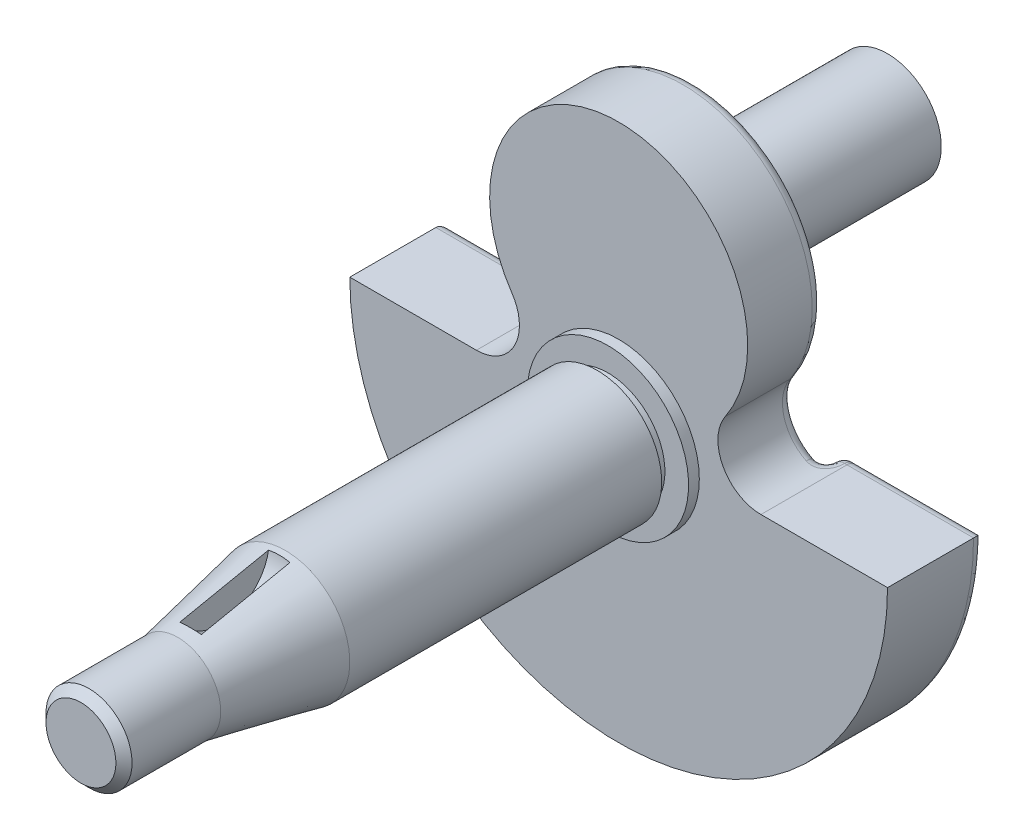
ISO-10303-21;
HEADER;
FILE_DESCRIPTION(('STEP AP214'),'2;1');
FILE_NAME('part.step','',(''),(''),'','','');
FILE_SCHEMA(('AUTOMOTIVE_DESIGN { 1 0 10303 214 1 1 1 1 }'));
ENDSEC;
DATA;
#1=APPLICATION_CONTEXT('core data for automotive mechanical design processes');
#2=APPLICATION_PROTOCOL_DEFINITION('international standard','automotive_design',2000,#1);
#3=PRODUCT_CONTEXT('',#1,'mechanical');
#4=PRODUCT('Part','Part','',(#3));
#5=PRODUCT_RELATED_PRODUCT_CATEGORY('part','',(#4));
#6=PRODUCT_DEFINITION_FORMATION('','',#4);
#7=PRODUCT_DEFINITION_CONTEXT('part definition',#1,'design');
#8=PRODUCT_DEFINITION('design','',#6,#7);
#9=PRODUCT_DEFINITION_SHAPE('','',#8);
#10=(LENGTH_UNIT() NAMED_UNIT(*) SI_UNIT(.MILLI.,.METRE.));
#11=(NAMED_UNIT(*) PLANE_ANGLE_UNIT() SI_UNIT($,.RADIAN.));
#12=(NAMED_UNIT(*) SI_UNIT($,.STERADIAN.) SOLID_ANGLE_UNIT());
#13=UNCERTAINTY_MEASURE_WITH_UNIT(LENGTH_MEASURE(1.E-05),#10,'distance_accuracy_value','');
#14=(GEOMETRIC_REPRESENTATION_CONTEXT(3) GLOBAL_UNCERTAINTY_ASSIGNED_CONTEXT((#13)) GLOBAL_UNIT_ASSIGNED_CONTEXT((#10,
#11,#12)) REPRESENTATION_CONTEXT('',''));
#15=CARTESIAN_POINT('',(0.,0.,0.));
#16=DIRECTION('',(0.,0.,1.));
#17=DIRECTION('',(1.,0.,0.));
#18=AXIS2_PLACEMENT_3D('',#15,#16,#17);
#19=CARTESIAN_POINT('',(0.,0.,74.5));
#20=DIRECTION('',(0.,0.,-1.));
#21=DIRECTION('',(-1.,0.,0.));
#22=AXIS2_PLACEMENT_3D('',#19,#20,#21);
#23=CONICAL_SURFACE('',#22,12.,0.19739555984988);
#24=CARTESIAN_POINT('',(0.,0.,74.5));
#25=DIRECTION('',(0.,0.,-1.));
#26=DIRECTION('',(-1.,0.,0.));
#27=AXIS2_PLACEMENT_3D('',#24,#25,#26);
#28=CIRCLE('',#27,12.);
#29=CARTESIAN_POINT('',(-12.,0.,74.5));
#30=VERTEX_POINT('',#29);
#31=EDGE_CURVE('E228',#30,#30,#28,.T.);
#32=ORIENTED_EDGE('',*,*,#31,.F.);
#33=EDGE_LOOP('',(#32));
#34=FACE_BOUND('',#33,.T.);
#35=CARTESIAN_POINT('',(0.,0.,94.5));
#36=DIRECTION('',(0.,0.,-1.));
#37=DIRECTION('',(-1.,0.,0.));
#38=AXIS2_PLACEMENT_3D('',#35,#36,#37);
#39=CIRCLE('',#38,8.);
#40=CARTESIAN_POINT('',(-8.,0.,94.5));
#41=VERTEX_POINT('',#40);
#42=EDGE_CURVE('E231',#41,#41,#39,.T.);
#43=ORIENTED_EDGE('',*,*,#42,.T.);
#44=EDGE_LOOP('',(#43));
#45=FACE_BOUND('',#44,.T.);
#46=CARTESIAN_POINT('',(-2.0001999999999,8.24048514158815,92.1011806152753));
#47=CARTESIAN_POINT('',(-1.88846339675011,8.26447819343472,92.1163881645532));
#48=CARTESIAN_POINT('',(-1.77613457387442,8.28652189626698,92.1302078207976));
#49=CARTESIAN_POINT('',(-1.55047016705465,8.32662195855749,92.1551464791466));
#50=CARTESIAN_POINT('',(-1.43713458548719,8.3446783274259,92.1662654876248));
#51=CARTESIAN_POINT('',(-1.09585749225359,8.39273727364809,92.1956865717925));
#52=CARTESIAN_POINT('',(-0.866671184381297,8.41662418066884,92.2100492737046));
#53=CARTESIAN_POINT('',(-0.411499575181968,8.44730926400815,92.22844197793));
#54=CARTESIAN_POINT('',(-0.185544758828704,8.45444717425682,92.2326774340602));
#55=CARTESIAN_POINT('',(0.2661710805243,8.45251923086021,92.2315293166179));
#56=CARTESIAN_POINT('',(0.491932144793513,8.44346089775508,92.2261502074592));
#57=CARTESIAN_POINT('',(0.932155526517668,8.41003651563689,92.2060801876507));
#58=CARTESIAN_POINT('',(1.14668701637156,8.3863439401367,92.1917987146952));
#59=CARTESIAN_POINT('',(1.46733451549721,8.33993160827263,92.163343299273));
#60=CARTESIAN_POINT('',(1.57456020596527,8.32253350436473,92.1526141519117));
#61=CARTESIAN_POINT('',(1.78810140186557,8.28416760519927,92.1287316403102));
#62=CARTESIAN_POINT('',(1.89441688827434,8.26319973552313,92.115578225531));
#63=CARTESIAN_POINT('',(2.0001999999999,8.24048514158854,92.1011806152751));
#64=B_SPLINE_CURVE_WITH_KNOTS('',3,(#46,#47,#48,#49,#50,#51,#52,#53,#54,#55,#56,#57,#58,#59,#60,
#61,#62,#63),.UNSPECIFIED.,.F.,.F.,(4,2,2,2,2,2,2,2,4),(0.,0.345817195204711,0.691633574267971,
1.38334516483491,2.06090013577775,2.73814057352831,3.38632312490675,3.71371515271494,
4.04111400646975),.UNSPECIFIED.);
#65=CARTESIAN_POINT('',(-2.,8.24052808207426,92.1012078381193));
#66=VERTEX_POINT('',#65);
#67=CARTESIAN_POINT('',(2.,8.24052808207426,92.1012078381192));
#68=VERTEX_POINT('',#67);
#69=EDGE_CURVE('E159',#66,#68,#64,.T.);
#70=ORIENTED_EDGE('',*,*,#69,.F.);
#71=CARTESIAN_POINT('',(-2.,14.8761479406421,59.4500537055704));
#72=CARTESIAN_POINT('',(-1.99999999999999,14.5645552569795,60.9941047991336));
#73=CARTESIAN_POINT('',(-2.,14.2528030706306,62.5381237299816));
#74=CARTESIAN_POINT('',(-2.00000000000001,13.6288910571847,65.626079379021));
#75=CARTESIAN_POINT('',(-2.00000000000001,13.3167312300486,67.1700160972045));
#76=CARTESIAN_POINT('',(-1.99999999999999,12.6919099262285,70.2578159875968));
#77=CARTESIAN_POINT('',(-1.99999999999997,12.3792484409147,71.8016791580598));
#78=CARTESIAN_POINT('',(-2.00000000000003,11.753303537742,74.8892793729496));
#79=CARTESIAN_POINT('',(-2.00000000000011,11.4400201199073,76.4330164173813));
#80=CARTESIAN_POINT('',(-2.00000000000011,10.8126616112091,79.5203290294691));
#81=CARTESIAN_POINT('',(-2.00000000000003,10.4985865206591,81.0639045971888));
#82=CARTESIAN_POINT('',(-1.99999999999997,9.86940633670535,84.150844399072));
#83=CARTESIAN_POINT('',(-1.99999999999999,9.55430124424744,85.6942086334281));
#84=CARTESIAN_POINT('',(-2.00000000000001,8.92271740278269,88.7806335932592));
#85=CARTESIAN_POINT('',(-2.,8.60623867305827,90.3236943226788));
#86=CARTESIAN_POINT('',(-2.,7.9713846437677,93.4094312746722));
#87=CARTESIAN_POINT('',(-2.,7.65300933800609,94.9521074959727));
#88=CARTESIAN_POINT('',(-2.,7.16958290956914,97.2840476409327));
#89=CARTESIAN_POINT('',(-2.,7.00554469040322,98.0735215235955));
#90=CARTESIAN_POINT('',(-2.,6.6765763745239,99.652283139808));
#91=CARTESIAN_POINT('',(-2.,6.51164627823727,100.441570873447));
#92=CARTESIAN_POINT('',(-2.,6.1806744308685,102.01990551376));
#93=CARTESIAN_POINT('',(-2.,6.01463269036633,102.808952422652));
#94=CARTESIAN_POINT('',(-2.,5.68112970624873,104.38674796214));
#95=CARTESIAN_POINT('',(-2.,5.5136684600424,105.175496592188));
#96=CARTESIAN_POINT('',(-2.,5.17688539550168,106.752631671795));
#97=CARTESIAN_POINT('',(-2.,5.00756349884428,107.541018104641));
#98=CARTESIAN_POINT('',(-2.,4.6664363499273,109.117250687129));
#99=CARTESIAN_POINT('',(-2.,4.49463111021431,109.905096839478));
#100=CARTESIAN_POINT('',(-2.,4.23430791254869,111.086303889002));
#101=CARTESIAN_POINT('',(-2.,4.14709611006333,111.479952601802));
#102=CARTESIAN_POINT('',(-2.,3.97161571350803,112.267013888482));
#103=CARTESIAN_POINT('',(-2.,3.88334712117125,112.660426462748));
#104=CARTESIAN_POINT('',(-2.,3.70552764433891,113.446969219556));
#105=CARTESIAN_POINT('',(-2.,3.61597673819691,113.840099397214));
#106=CARTESIAN_POINT('',(-2.,3.43525833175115,114.625990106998));
#107=CARTESIAN_POINT('',(-2.,3.34409082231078,115.018750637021));
#108=CARTESIAN_POINT('',(-2.,3.25194763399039,115.411283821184));
#109=B_SPLINE_CURVE_WITH_KNOTS('',3,(#71,#72,#73,#74,#75,#76,#77,#78,#79,#80,#81,#82,#83,#84,
#85,#86,#87,#88,#89,#90,#91,#92,#93,#94,#95,#96,#97,#98,#99,#100,#101,#102,#103,#104,#105,#106,
#107,#108),.UNSPECIFIED.,.F.,.F.,(4,2,2,2,2,2,2,2,2,2,2,2,2,2,2,2,2,2,4),(0.,4.72553217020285,
9.45106479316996,14.1766795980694,18.9022942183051,23.6279069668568,28.3535153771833,
33.0790576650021,37.804615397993,40.2236226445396,42.6426287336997,45.0616118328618,
47.4805993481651,49.8996890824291,52.3187665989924,53.528346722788,54.7379248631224,
55.9475234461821,57.157128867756),.UNSPECIFIED.);
#110=CARTESIAN_POINT('',(-2.00000000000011,11.605275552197,75.6182497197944));
#111=VERTEX_POINT('',#110);
#112=EDGE_CURVE('E11',#66,#111,#109,.F.);
#113=ORIENTED_EDGE('',*,*,#112,.T.);
#114=CARTESIAN_POINT('',(2.00020000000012,11.6052398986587,75.6182555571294));
#115=CARTESIAN_POINT('',(1.83464353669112,11.6347557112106,75.6134333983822));
#116=CARTESIAN_POINT('',(1.66841015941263,11.6605779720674,75.6093466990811));
#117=CARTESIAN_POINT('',(1.33493975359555,11.704822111,75.6024926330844));
#118=CARTESIAN_POINT('',(1.16770275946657,11.7232442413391,75.5997252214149));
#119=CARTESIAN_POINT('',(0.833881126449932,11.7525611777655,75.5953750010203));
#120=CARTESIAN_POINT('',(0.667301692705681,11.7635140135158,75.5937830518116));
#121=CARTESIAN_POINT('',(0.333814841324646,11.7781185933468,75.5916698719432));
#122=CARTESIAN_POINT('',(0.166907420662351,11.7817702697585,75.5911486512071));
#123=CARTESIAN_POINT('',(-0.166907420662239,11.7817702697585,75.5911486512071));
#124=CARTESIAN_POINT('',(-0.333814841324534,11.7781185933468,75.5916698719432));
#125=CARTESIAN_POINT('',(-0.667301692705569,11.7635140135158,75.5937830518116));
#126=CARTESIAN_POINT('',(-0.83388112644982,11.7525611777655,75.5953750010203));
#127=CARTESIAN_POINT('',(-1.16770275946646,11.7232442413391,75.5997252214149));
#128=CARTESIAN_POINT('',(-1.33493975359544,11.7048221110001,75.6024926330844));
#129=CARTESIAN_POINT('',(-1.66841015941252,11.6605779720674,75.6093466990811));
#130=CARTESIAN_POINT('',(-1.83464353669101,11.6347557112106,75.6134333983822));
#131=CARTESIAN_POINT('',(-2.00020000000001,11.6052398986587,75.6182555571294));
#132=B_SPLINE_CURVE_WITH_KNOTS('',3,(#114,#115,#116,#117,#118,#119,#120,#121,#122,#123,#124,
#125,#126,#127,#128,#129,#130,#131),.UNSPECIFIED.,.F.,.F.,(4,2,2,2,2,2,2,2,4),(0.,
0.50466063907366,1.00930407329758,1.5099808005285,2.01066216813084,2.51134353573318,
3.0120202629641,3.51666369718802,4.02132433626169),.UNSPECIFIED.);
#133=CARTESIAN_POINT('',(2.,11.6052755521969,75.6182497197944));
#134=VERTEX_POINT('',#133);
#135=EDGE_CURVE('E50',#134,#111,#132,.T.);
#136=ORIENTED_EDGE('',*,*,#135,.F.);
#137=CARTESIAN_POINT('',(2.,14.8761479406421,59.4500537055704));
#138=CARTESIAN_POINT('',(1.99999999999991,14.5645552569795,60.9941047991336));
#139=CARTESIAN_POINT('',(1.99999999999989,14.2528030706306,62.5381237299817));
#140=CARTESIAN_POINT('',(1.99999999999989,13.6288910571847,65.626079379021));
#141=CARTESIAN_POINT('',(1.9999999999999,13.3167312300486,67.1700160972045));
#142=CARTESIAN_POINT('',(1.99999999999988,12.6919099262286,70.2578159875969));
#143=CARTESIAN_POINT('',(1.99999999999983,12.3792484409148,71.8016791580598));
#144=CARTESIAN_POINT('',(1.99999999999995,11.753303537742,74.8892793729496));
#145=CARTESIAN_POINT('',(2.00000000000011,11.4400201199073,76.4330164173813));
#146=CARTESIAN_POINT('',(2.00000000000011,10.8126616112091,79.5203290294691));
#147=CARTESIAN_POINT('',(1.99999999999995,10.4985865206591,81.0639045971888));
#148=CARTESIAN_POINT('',(1.99999999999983,9.86940633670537,84.150844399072));
#149=CARTESIAN_POINT('',(1.99999999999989,9.55430124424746,85.6942086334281));
#150=CARTESIAN_POINT('',(1.9999999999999,8.92271740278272,88.7806335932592));
#151=CARTESIAN_POINT('',(1.99999999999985,8.60623867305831,90.3236943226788));
#152=CARTESIAN_POINT('',(1.99999999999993,7.97138464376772,93.4094312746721));
#153=CARTESIAN_POINT('',(2.00000000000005,7.65300933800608,94.9521074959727));
#154=CARTESIAN_POINT('',(1.99999999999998,7.16958290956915,97.2840476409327));
#155=CARTESIAN_POINT('',(1.99999999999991,7.00554469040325,98.0735215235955));
#156=CARTESIAN_POINT('',(1.99999999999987,6.67657637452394,99.652283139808));
#157=CARTESIAN_POINT('',(1.99999999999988,6.5116462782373,100.441570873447));
#158=CARTESIAN_POINT('',(1.9999999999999,6.18067443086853,102.01990551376));
#159=CARTESIAN_POINT('',(1.99999999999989,6.01463269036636,102.808952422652));
#160=CARTESIAN_POINT('',(1.99999999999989,5.68112970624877,104.38674796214));
#161=CARTESIAN_POINT('',(1.99999999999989,5.51366846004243,105.175496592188));
#162=CARTESIAN_POINT('',(1.99999999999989,5.17688539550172,106.752631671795));
#163=CARTESIAN_POINT('',(1.99999999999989,5.00756349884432,107.541018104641));
#164=CARTESIAN_POINT('',(1.99999999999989,4.66643634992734,109.117250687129));
#165=CARTESIAN_POINT('',(1.99999999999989,4.49463111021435,109.905096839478));
#166=CARTESIAN_POINT('',(1.99999999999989,4.23430791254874,111.086303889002));
#167=CARTESIAN_POINT('',(1.99999999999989,4.14709611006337,111.479952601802));
#168=CARTESIAN_POINT('',(1.99999999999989,3.97161571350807,112.267013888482));
#169=CARTESIAN_POINT('',(1.99999999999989,3.88334712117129,112.660426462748));
#170=CARTESIAN_POINT('',(1.99999999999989,3.70552764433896,113.446969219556));
#171=CARTESIAN_POINT('',(1.99999999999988,3.61597673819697,113.840099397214));
#172=CARTESIAN_POINT('',(1.9999999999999,3.43525833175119,114.625990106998));
#173=CARTESIAN_POINT('',(1.99999999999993,3.34409082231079,115.018750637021));
#174=CARTESIAN_POINT('',(2.,3.25194763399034,115.411283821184));
#175=B_SPLINE_CURVE_WITH_KNOTS('',3,(#137,#138,#139,#140,#141,#142,#143,#144,#145,#146,#147,
#148,#149,#150,#151,#152,#153,#154,#155,#156,#157,#158,#159,#160,#161,#162,#163,#164,#165,#166,
#167,#168,#169,#170,#171,#172,#173,#174),.UNSPECIFIED.,.F.,.F.,(4,2,2,2,2,2,2,2,2,2,2,2,2,2,2,2,
2,2,4),(0.,4.72553217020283,9.45106479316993,14.1766795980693,18.902294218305,23.6279069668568,
28.3535153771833,33.079057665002,37.8046153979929,40.2236226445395,42.6426287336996,
45.0616118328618,47.480599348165,49.8996890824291,52.3187665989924,53.528346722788,
54.7379248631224,55.9475234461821,57.1571288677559),.UNSPECIFIED.);
#176=EDGE_CURVE('E154',#68,#134,#175,.F.);
#177=ORIENTED_EDGE('',*,*,#176,.F.);
#178=EDGE_LOOP('',(#70,#113,#136,#177));
#179=FACE_BOUND('',#178,.T.);
#180=ADVANCED_FACE('F36',(#34,#45,#179),#23,.T.);
#181=CARTESIAN_POINT('',(0.,26.,-2.49999999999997));
#182=DIRECTION('',(0.,0.,-1.));
#183=DIRECTION('',(-1.,0.,0.));
#184=AXIS2_PLACEMENT_3D('',#181,#182,#183);
#185=PLANE('',#184);
#186=CARTESIAN_POINT('',(0.,26.,-2.49999999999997));
#187=DIRECTION('',(0.,0.,-1.));
#188=DIRECTION('',(-1.,0.,0.));
#189=AXIS2_PLACEMENT_3D('',#186,#187,#188);
#190=CIRCLE('',#189,18.);
#191=CARTESIAN_POINT('',(-18.,26.,-2.49999999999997));
#192=VERTEX_POINT('',#191);
#193=EDGE_CURVE('E232',#192,#192,#190,.T.);
#194=ORIENTED_EDGE('',*,*,#193,.T.);
#195=EDGE_LOOP('',(#194));
#196=FACE_BOUND('',#195,.T.);
#197=CARTESIAN_POINT('',(0.,26.,-2.49999999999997));
#198=DIRECTION('',(0.,0.,-1.));
#199=DIRECTION('',(-1.,0.,0.));
#200=AXIS2_PLACEMENT_3D('',#197,#198,#199);
#201=CIRCLE('',#200,10.);
#202=CARTESIAN_POINT('',(-10.,26.,-2.49999999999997));
#203=VERTEX_POINT('',#202);
#204=EDGE_CURVE('E342',#203,#203,#201,.T.);
#205=ORIENTED_EDGE('',*,*,#204,.F.);
#206=EDGE_LOOP('',(#205));
#207=FACE_BOUND('',#206,.T.);
#208=ADVANCED_FACE('F203',(#196,#207),#185,.T.);
#209=CARTESIAN_POINT('',(0.,13.,-1.49999999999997));
#210=DIRECTION('',(0.,0.,-1.));
#211=DIRECTION('',(-1.,0.,0.));
#212=AXIS2_PLACEMENT_3D('',#209,#210,#211);
#213=PLANE('',#212);
#214=CARTESIAN_POINT('',(0.,26.,-1.49999999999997));
#215=DIRECTION('',(0.,0.,-1.));
#216=DIRECTION('',(-1.,0.,0.));
#217=AXIS2_PLACEMENT_3D('',#214,#215,#216);
#218=CIRCLE('',#217,19.6733200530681);
#219=CARTESIAN_POINT('',(-19.6733200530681,26.,-1.49999999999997));
#220=VERTEX_POINT('',#219);
#221=EDGE_CURVE('E325',#220,#220,#218,.F.);
#222=ORIENTED_EDGE('',*,*,#221,.T.);
#223=EDGE_LOOP('',(#222));
#224=FACE_BOUND('',#223,.T.);
#225=CARTESIAN_POINT('',(0.,0.,-1.49999999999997));
#226=DIRECTION('',(0.,0.,-1.));
#227=DIRECTION('',(-1.,0.,0.));
#228=AXIS2_PLACEMENT_3D('',#225,#226,#227);
#229=CIRCLE('',#228,22.);
#230=CARTESIAN_POINT('',(21.9798446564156,-0.941503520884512,-1.49999999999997));
#231=VERTEX_POINT('',#230);
#232=CARTESIAN_POINT('',(-21.9798446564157,-0.941503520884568,-1.49999999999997));
#233=VERTEX_POINT('',#232);
#234=EDGE_CURVE('E64',#231,#233,#229,.T.);
#235=ORIENTED_EDGE('',*,*,#234,.T.);
#236=CARTESIAN_POINT('',(-26.4575131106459,8.00000000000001,-1.5));
#237=DIRECTION('',(0.,0.,-1.));
#238=DIRECTION('',(-1.,0.,0.));
#239=AXIS2_PLACEMENT_3D('',#236,#237,#238);
#240=CIRCLE('',#239,10.);
#241=CARTESIAN_POINT('',(-18.189540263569,13.6249999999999,-1.49999999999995));
#242=VERTEX_POINT('',#241);
#243=EDGE_CURVE('E318',#233,#242,#240,.F.);
#244=ORIENTED_EDGE('',*,*,#243,.T.);
#245=CARTESIAN_POINT('',(0.,26.,-1.49999999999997));
#246=DIRECTION('',(0.,0.,-1.));
#247=DIRECTION('',(-1.,0.,0.));
#248=AXIS2_PLACEMENT_3D('',#245,#246,#247);
#249=CIRCLE('',#248,22.);
#250=CARTESIAN_POINT('',(18.1895402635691,13.6249999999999,-1.49999999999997));
#251=VERTEX_POINT('',#250);
#252=EDGE_CURVE('E313',#242,#251,#249,.T.);
#253=ORIENTED_EDGE('',*,*,#252,.T.);
#254=CARTESIAN_POINT('',(26.4575131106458,8.00000000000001,-1.49999999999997));
#255=DIRECTION('',(0.,0.,-1.));
#256=DIRECTION('',(-1.,0.,0.));
#257=AXIS2_PLACEMENT_3D('',#254,#255,#256);
#258=CIRCLE('',#257,10.);
#259=EDGE_CURVE('E315',#251,#231,#258,.F.);
#260=ORIENTED_EDGE('',*,*,#259,.T.);
#261=EDGE_LOOP('',(#235,#244,#253,#260));
#262=FACE_BOUND('',#261,.T.);
#263=ADVANCED_FACE('F206',(#224,#262),#213,.T.);
#264=CARTESIAN_POINT('',(-1.11022302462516E-13,26.,-5.49999999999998));
#265=DIRECTION('',(0.,0.,1.));
#266=DIRECTION('',(1.,0.,0.));
#267=AXIS2_PLACEMENT_3D('',#264,#265,#266);
#268=CYLINDRICAL_SURFACE('',#267,24.);
#269=DIRECTION('',(0.,0.,1.));
#270=VECTOR('',#269,1.);
#271=CARTESIAN_POINT('',(19.8431348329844,12.5,-5.49999999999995));
#272=LINE('',#271,#270);
#273=CARTESIAN_POINT('',(19.8431348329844,12.5,0.500000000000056));
#274=VERTEX_POINT('',#273);
#275=CARTESIAN_POINT('',(19.8431348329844,12.5,12.5000000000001));
#276=VERTEX_POINT('',#275);
#277=EDGE_CURVE('E767',#274,#276,#272,.T.);
#278=ORIENTED_EDGE('',*,*,#277,.F.);
#279=CARTESIAN_POINT('',(0.,26.,0.5));
#280=DIRECTION('',(0.,0.,-1.));
#281=DIRECTION('',(-1.,0.,0.));
#282=AXIS2_PLACEMENT_3D('',#279,#280,#281);
#283=CIRCLE('',#282,24.);
#284=CARTESIAN_POINT('',(-19.8431348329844,12.5,0.5));
#285=VERTEX_POINT('',#284);
#286=EDGE_CURVE('E320',#274,#285,#283,.F.);
#287=ORIENTED_EDGE('',*,*,#286,.T.);
#288=DIRECTION('',(0.,0.,1.));
#289=VECTOR('',#288,1.);
#290=CARTESIAN_POINT('',(-19.8431348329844,12.5,-5.49999999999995));
#291=LINE('',#290,#289);
#292=CARTESIAN_POINT('',(-19.8431348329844,12.5,12.5));
#293=VERTEX_POINT('',#292);
#294=EDGE_CURVE('E785',#285,#293,#291,.T.);
#295=ORIENTED_EDGE('',*,*,#294,.T.);
#296=CARTESIAN_POINT('',(0.,26.0000000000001,12.5));
#297=DIRECTION('',(0.,0.,1.));
#298=DIRECTION('',(1.,0.,0.));
#299=AXIS2_PLACEMENT_3D('',#296,#297,#298);
#300=CIRCLE('',#299,24.);
#301=EDGE_CURVE('E784',#276,#293,#300,.T.);
#302=ORIENTED_EDGE('',*,*,#301,.F.);
#303=EDGE_LOOP('',(#278,#287,#295,#302));
#304=FACE_BOUND('',#303,.T.);
#305=ADVANCED_FACE('F296',(#304),#268,.T.);
#306=CARTESIAN_POINT('',(0.,0.,-5.49999999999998));
#307=DIRECTION('',(0.,0.,1.));
#308=DIRECTION('',(1.,0.,0.));
#309=AXIS2_PLACEMENT_3D('',#306,#307,#308);
#310=CYLINDRICAL_SURFACE('',#309,50.);
#311=DIRECTION('',(0.,0.,1.));
#312=VECTOR('',#311,1.);
#313=CARTESIAN_POINT('',(-50.,0.,-5.49999999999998));
#314=LINE('',#313,#312);
#315=CARTESIAN_POINT('',(-50.,0.,-3.49999999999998));
#316=VERTEX_POINT('',#315);
#317=CARTESIAN_POINT('',(-50.,0.,12.5000000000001));
#318=VERTEX_POINT('',#317);
#319=EDGE_CURVE('E780',#316,#318,#314,.T.);
#320=ORIENTED_EDGE('',*,*,#319,.F.);
#321=CARTESIAN_POINT('',(0.,0.,-3.49999999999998));
#322=DIRECTION('',(0.,0.,1.));
#323=DIRECTION('',(1.,0.,0.));
#324=AXIS2_PLACEMENT_3D('',#321,#322,#323);
#325=CIRCLE('',#324,50.);
#326=CARTESIAN_POINT('',(50.,0.,-3.49999999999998));
#327=VERTEX_POINT('',#326);
#328=EDGE_CURVE('E750',#316,#327,#325,.T.);
#329=ORIENTED_EDGE('',*,*,#328,.T.);
#330=DIRECTION('',(0.,0.,1.));
#331=VECTOR('',#330,1.);
#332=CARTESIAN_POINT('',(50.,0.,-5.49999999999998));
#333=LINE('',#332,#331);
#334=CARTESIAN_POINT('',(49.9999999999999,0.,12.5));
#335=VERTEX_POINT('',#334);
#336=EDGE_CURVE('E759',#327,#335,#333,.T.);
#337=ORIENTED_EDGE('',*,*,#336,.T.);
#338=CARTESIAN_POINT('',(-1.11022302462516E-13,0.,12.5));
#339=DIRECTION('',(0.,0.,1.));
#340=DIRECTION('',(1.,0.,0.));
#341=AXIS2_PLACEMENT_3D('',#338,#339,#340);
#342=CIRCLE('',#341,50.);
#343=EDGE_CURVE('E671',#318,#335,#342,.T.);
#344=ORIENTED_EDGE('',*,*,#343,.F.);
#345=EDGE_LOOP('',(#320,#329,#337,#344));
#346=FACE_BOUND('',#345,.T.);
#347=ADVANCED_FACE('F613',(#346),#310,.T.);
#348=CARTESIAN_POINT('',(-50.,0.,-5.49999999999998));
#349=DIRECTION('',(0.,1.,0.));
#350=DIRECTION('',(-1.,0.,0.));
#351=AXIS2_PLACEMENT_3D('',#348,#349,#350);
#352=PLANE('',#351);
#353=DIRECTION('',(0.,0.,1.));
#354=VECTOR('',#353,1.);
#355=CARTESIAN_POINT('',(-26.4575131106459,0.,-5.49999999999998));
#356=LINE('',#355,#354);
#357=CARTESIAN_POINT('',(-26.4575131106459,0.,-3.49999999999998));
#358=VERTEX_POINT('',#357);
#359=CARTESIAN_POINT('',(-26.4575131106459,0.,12.5));
#360=VERTEX_POINT('',#359);
#361=EDGE_CURVE('E798',#358,#360,#356,.T.);
#362=ORIENTED_EDGE('',*,*,#361,.F.);
#363=DIRECTION('',(-1.,0.,0.));
#364=VECTOR('',#363,1.);
#365=CARTESIAN_POINT('',(-50.,0.,-3.49999999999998));
#366=LINE('',#365,#364);
#367=EDGE_CURVE('E736',#358,#316,#366,.T.);
#368=ORIENTED_EDGE('',*,*,#367,.T.);
#369=ORIENTED_EDGE('',*,*,#319,.T.);
#370=DIRECTION('',(-1.,0.,0.));
#371=VECTOR('',#370,1.);
#372=CARTESIAN_POINT('',(-50.,0.,12.5000000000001));
#373=LINE('',#372,#371);
#374=EDGE_CURVE('E802',#360,#318,#373,.T.);
#375=ORIENTED_EDGE('',*,*,#374,.F.);
#376=EDGE_LOOP('',(#362,#368,#369,#375));
#377=FACE_BOUND('',#376,.T.);
#378=ADVANCED_FACE('F293',(#377),#352,.T.);
#379=CARTESIAN_POINT('',(-26.4575131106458,8.00000000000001,-5.49999999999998));
#380=DIRECTION('',(0.,0.,1.));
#381=DIRECTION('',(1.,0.,0.));
#382=AXIS2_PLACEMENT_3D('',#379,#380,#381);
#383=CYLINDRICAL_SURFACE('',#382,8.);
#384=CARTESIAN_POINT('',(-21.202454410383,0.0412445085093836,-1.66588304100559));
#385=CARTESIAN_POINT('',(-22.0217569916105,1.32283175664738,-1.30855290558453));
#386=CARTESIAN_POINT('',(-21.615462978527,1.63175451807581,0.168233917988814));
#387=CARTESIAN_POINT('',(-21.2617438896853,-0.0524518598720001,-1.64018087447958));
#388=CARTESIAN_POINT('',(-22.105749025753,1.2685712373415,-1.30633330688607));
#389=CARTESIAN_POINT('',(-21.7101727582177,1.5597222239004,0.219638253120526));
#390=CARTESIAN_POINT('',(-21.3224547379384,-0.143662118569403,-1.61698958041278));
#391=CARTESIAN_POINT('',(-22.1870700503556,1.2186610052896,-1.30956679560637));
#392=CARTESIAN_POINT('',(-21.807682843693,1.48893642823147,0.266020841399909));
#393=CARTESIAN_POINT('',(-21.4467298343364,-0.320522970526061,-1.57626802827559));
#394=CARTESIAN_POINT('',(-22.3446473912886,1.12580897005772,-1.3255010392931));
#395=CARTESIAN_POINT('',(-22.0080906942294,1.35037968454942,0.347463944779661));
#396=CARTESIAN_POINT('',(-21.5103004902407,-0.406159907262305,-1.5587512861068));
#397=CARTESIAN_POINT('',(-22.4207047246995,1.08307246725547,-1.33840222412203));
#398=CARTESIAN_POINT('',(-22.1110006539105,1.28261626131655,0.382497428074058));
#399=CARTESIAN_POINT('',(-21.6403162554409,-0.571206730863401,-1.53008182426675));
#400=CARTESIAN_POINT('',(-22.5656661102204,1.00437093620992,-1.37254201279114));
#401=CARTESIAN_POINT('',(-22.3220172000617,1.15067690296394,0.43983635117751));
#402=CARTESIAN_POINT('',(-21.7067730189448,-0.650586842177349,-1.51895811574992));
#403=CARTESIAN_POINT('',(-22.6342664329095,0.968638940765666,-1.39394553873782));
#404=CARTESIAN_POINT('',(-22.4301450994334,1.08651849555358,0.462083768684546));
#405=CARTESIAN_POINT('',(-21.8418212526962,-0.801816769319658,-1.5039190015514));
#406=CARTESIAN_POINT('',(-22.7623106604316,0.903271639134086,-1.44298613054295));
#407=CARTESIAN_POINT('',(-22.6501713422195,0.962950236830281,0.492161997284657));
#408=CARTESIAN_POINT('',(-21.9104103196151,-0.873674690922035,-1.49999575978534));
#409=CARTESIAN_POINT('',(-22.8214553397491,0.87381220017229,-1.47066686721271));
#410=CARTESIAN_POINT('',(-22.7620654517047,0.903535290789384,0.500008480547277));
#411=CARTESIAN_POINT('',(-22.0776034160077,-1.03700183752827,-1.50000596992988));
#412=CARTESIAN_POINT('',(-22.9526632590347,0.808078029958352,-1.54204158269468));
#413=CARTESIAN_POINT('',(-23.0349150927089,0.766913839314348,0.499988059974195));
#414=CARTESIAN_POINT('',(-22.1770377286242,-1.12451340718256,-1.50779726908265));
#415=CARTESIAN_POINT('',(-23.0188573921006,0.774563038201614,-1.58727252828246));
#416=CARTESIAN_POINT('',(-23.1972642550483,0.692336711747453,0.484405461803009));
#417=CARTESIAN_POINT('',(-22.376349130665,-1.28196435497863,-1.54028325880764));
#418=CARTESIAN_POINT('',(-23.1353937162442,0.710923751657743,-1.67860445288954));
#419=CARTESIAN_POINT('',(-23.5223948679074,0.555801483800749,0.419433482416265));
#420=CARTESIAN_POINT('',(-22.4762238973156,-1.35195727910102,-1.56492556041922));
#421=CARTESIAN_POINT('',(-23.1851208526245,0.681074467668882,-1.72437705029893));
#422=CARTESIAN_POINT('',(-23.6851734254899,0.493805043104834,0.37014887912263));
#423=CARTESIAN_POINT('',(-22.6738609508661,-1.47498594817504,-1.63163902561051));
#424=CARTESIAN_POINT('',(-23.2773424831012,0.619965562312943,-1.81491313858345));
#425=CARTESIAN_POINT('',(-24.0067622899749,0.382725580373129,0.236721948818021));
#426=CARTESIAN_POINT('',(-22.7716136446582,-1.52795549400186,-1.67377680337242));
#427=CARTESIAN_POINT('',(-23.3193957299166,0.588929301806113,-1.85931122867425));
#428=CARTESIAN_POINT('',(-24.1655549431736,0.333693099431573,0.152446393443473));
#429=CARTESIAN_POINT('',(-22.961038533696,-1.6179908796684,-1.77492540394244));
#430=CARTESIAN_POINT('',(-23.4044581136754,0.524288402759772,-1.95044136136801));
#431=CARTESIAN_POINT('',(-24.4726835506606,0.248489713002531,-0.049850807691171));
#432=CARTESIAN_POINT('',(-23.0527050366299,-1.65504200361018,-1.83395175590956));
#433=CARTESIAN_POINT('',(-23.4471865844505,0.490895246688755,-1.99687399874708));
#434=CARTESIAN_POINT('',(-24.6210097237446,0.212330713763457,-0.167903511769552));
#435=CARTESIAN_POINT('',(-23.2227997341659,-1.71450111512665,-1.96456029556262));
#436=CARTESIAN_POINT('',(-23.5354030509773,0.425079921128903,-2.09667086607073));
#437=CARTESIAN_POINT('',(-24.8957488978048,0.152714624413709,-0.42912059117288));
#438=CARTESIAN_POINT('',(-23.3016158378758,-1.73744562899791,-2.03553080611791));
#439=CARTESIAN_POINT('',(-23.5804930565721,0.392818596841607,-2.14941374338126));
#440=CARTESIAN_POINT('',(-25.0228096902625,0.128798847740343,-0.571061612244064));
#441=CARTESIAN_POINT('',(-23.4476939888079,-1.77384538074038,-2.18959944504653));
#442=CARTESIAN_POINT('',(-23.6729591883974,0.331032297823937,-2.26825866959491));
#443=CARTESIAN_POINT('',(-25.2579609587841,0.0895441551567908,-0.879198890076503));
#444=CARTESIAN_POINT('',(-23.5149572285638,-1.7873015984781,-2.27269632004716));
#445=CARTESIAN_POINT('',(-23.7202257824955,0.301545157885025,-2.33413353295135));
#446=CARTESIAN_POINT('',(-25.3660533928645,0.0742043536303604,-1.04539264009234));
#447=CARTESIAN_POINT('',(-23.6369518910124,-1.80783044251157,-2.45046065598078));
#448=CARTESIAN_POINT('',(-23.8127226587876,0.247446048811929,-2.48269535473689));
#449=CARTESIAN_POINT('',(-25.5618785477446,0.0496669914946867,-1.40092131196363));
#450=CARTESIAN_POINT('',(-23.6914201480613,-1.81477656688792,-2.54531839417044));
#451=CARTESIAN_POINT('',(-23.8579346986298,0.222880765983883,-2.5655493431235));
#452=CARTESIAN_POINT('',(-25.6491841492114,0.0405920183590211,-1.59063678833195));
#453=CARTESIAN_POINT('',(-23.7844194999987,-1.82458402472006,-2.74270656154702));
#454=CARTESIAN_POINT('',(-23.9389415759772,0.181000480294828,-2.74582050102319));
#455=CARTESIAN_POINT('',(-25.7981340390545,0.0268679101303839,-1.98541312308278));
#456=CARTESIAN_POINT('',(-23.8229504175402,-1.82744531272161,-2.84523707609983));
#457=CARTESIAN_POINT('',(-23.9748840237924,0.16358968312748,-2.84327562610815));
#458=CARTESIAN_POINT('',(-25.8597780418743,0.0222188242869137,-2.19047415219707));
#459=CARTESIAN_POINT('',(-23.883626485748,-1.83122630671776,-3.05786954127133));
#460=CARTESIAN_POINT('',(-24.0327593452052,0.136340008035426,-3.05101492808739));
#461=CARTESIAN_POINT('',(-25.9568107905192,0.0155307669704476,-2.61573908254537));
#462=CARTESIAN_POINT('',(-23.9053370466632,-1.8320955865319,-3.1680968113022));
#463=CARTESIAN_POINT('',(-24.0545025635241,0.126609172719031,-3.16183096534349));
#464=CARTESIAN_POINT('',(-25.9915032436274,0.0135600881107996,-2.83619362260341));
#465=CARTESIAN_POINT('',(-23.9300435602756,-1.83304319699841,-3.39063950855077));
#466=CARTESIAN_POINT('',(-24.0792369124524,0.115584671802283,-3.38774466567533));
#467=CARTESIAN_POINT('',(-26.0309807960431,0.0113540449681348,-3.28127901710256));
#468=CARTESIAN_POINT('',(-23.9330350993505,-1.83312134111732,-3.50295542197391));
#469=CARTESIAN_POINT('',(-24.0823173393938,0.114251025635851,-3.50325880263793));
#470=CARTESIAN_POINT('',(-26.0357588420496,0.0111190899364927,-3.50591084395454));
#471=CARTESIAN_POINT('',(-23.920146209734,-1.83267102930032,-3.72699459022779));
#472=CARTESIAN_POINT('',(-24.0693268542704,0.119996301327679,-3.73187641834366));
#473=CARTESIAN_POINT('',(-26.0151666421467,0.0122313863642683,-3.95398918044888));
#474=CARTESIAN_POINT('',(-23.9041928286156,-1.83214022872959,-3.83871387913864));
#475=CARTESIAN_POINT('',(-24.0531309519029,0.127130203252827,-3.84541224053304));
#476=CARTESIAN_POINT('',(-25.9896798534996,0.0135847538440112,-4.17742775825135));
#477=CARTESIAN_POINT('',(-23.8664593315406,-1.83014839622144,-4.00303142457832));
#478=CARTESIAN_POINT('',(-24.0164756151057,0.14401659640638,-4.00827889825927));
#479=CARTESIAN_POINT('',(-25.9293567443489,0.0174302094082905,-4.50606284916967));
#480=CARTESIAN_POINT('',(-23.8515634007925,-1.82928400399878,-4.05730265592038));
#481=CARTESIAN_POINT('',(-24.0021278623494,0.150708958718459,-4.06153009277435));
#482=CARTESIAN_POINT('',(-25.90553885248,0.0190166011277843,-4.6146053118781));
#483=CARTESIAN_POINT('',(-23.8172912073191,-1.82691206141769,-4.16439928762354));
#484=CARTESIAN_POINT('',(-23.9698873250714,0.166116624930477,-4.1650508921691));
#485=CARTESIAN_POINT('',(-25.8507177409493,0.0229994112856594,-4.82879857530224));
#486=CARTESIAN_POINT('',(-23.7979147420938,-1.8254044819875,-4.21722462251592));
#487=CARTESIAN_POINT('',(-23.9519711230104,0.174844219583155,-4.21534764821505));
#488=CARTESIAN_POINT('',(-25.8197141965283,0.0253958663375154,-4.93444924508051));
#489=CARTESIAN_POINT('',(-23.7763631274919,-1.82345348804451,-4.26916167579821));
#490=CARTESIAN_POINT('',(-23.9326287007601,0.184538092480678,-4.26373152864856));
#491=CARTESIAN_POINT('',(-25.7852148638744,0.0282991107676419,-5.03832335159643));
#492=(BOUNDED_SURFACE() B_SPLINE_SURFACE(3,2,((#384,#385,#386),(#387,#388,#389),(#390,#391,
#392),(#393,#394,#395),(#396,#397,#398),(#399,#400,#401),(#402,#403,#404),(#405,#406,#407),
(#408,#409,#410),(#411,#412,#413),(#414,#415,#416),(#417,#418,#419),(#420,#421,#422),(#423,#424,
#425),(#426,#427,#428),(#429,#430,#431),(#432,#433,#434),(#435,#436,#437),(#438,#439,#440),
(#441,#442,#443),(#444,#445,#446),(#447,#448,#449),(#450,#451,#452),(#453,#454,#455),(#456,#457,
#458),(#459,#460,#461),(#462,#463,#464),(#465,#466,#467),(#468,#469,#470),(#471,#472,#473),
(#474,#475,#476),(#477,#478,#479),(#480,#481,#482),(#483,#484,#485),(#486,#487,#488),(#489,#490,
#491)),.UNSPECIFIED.,.F.,.F.,.F.) B_SPLINE_SURFACE_WITH_KNOTS((4,2,2,2,2,2,2,2,2,2,2,2,2,2,2,2,
2,4),(3,3),(0.,0.472133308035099,0.945383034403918,1.42076371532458,1.89562674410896,
2.56420115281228,3.23070638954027,3.89977296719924,4.56945674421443,5.21177343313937,
5.85402377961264,6.50851003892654,7.16300358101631,7.83389032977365,8.5049352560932,
9.17857261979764,9.51593372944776,9.85331008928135),(0.,1.),
.UNSPECIFIED.) GEOMETRIC_REPRESENTATION_ITEM() RATIONAL_B_SPLINE_SURFACE(((1.,0.788024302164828,
1.),(1.,0.780395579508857,1.),(1.,0.772842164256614,1.),(1.,0.758093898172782,1.),(1.,
0.750899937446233,1.),(1.,0.737085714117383,1.),(1.,0.730468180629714,1.),(1.,0.718091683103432,
1.),(1.,0.71233179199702,1.),(1.,0.699750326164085,1.),(1.,0.693454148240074,1.),(1.,
0.683439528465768,1.),(1.,0.679713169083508,1.),(1.,0.674842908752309,1.),(1.,0.673708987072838,
1.),(1.,0.673670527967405,1.),(1.,0.674768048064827,1.),(1.,0.678413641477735,1.),(1.,
0.680900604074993,1.),(1.,0.686549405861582,1.),(1.,0.689711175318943,1.),(1.,0.696079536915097,
1.),(1.,0.699285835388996,1.),(1.,0.705081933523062,1.),(1.,0.707671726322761,1.),(1.,
0.711859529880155,1.),(1.,0.713431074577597,1.),(1.,0.715225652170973,1.),(1.,0.715448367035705,
1.),(1.,0.714505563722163,1.),(1.,0.713334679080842,1.),(1.,0.7106758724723,1.),(1.,
0.709637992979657,1.),(1.,0.707308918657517,1.),(1.,0.706017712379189,1.),(1.,0.704623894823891,1.))) REPRESENTATION_ITEM('') SURFACE());
#493=CARTESIAN_POINT('',(-25.7852148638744,0.0282991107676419,-5.03832335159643));
#494=CARTESIAN_POINT('',(-25.8197141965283,0.0253958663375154,-4.93444924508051));
#495=CARTESIAN_POINT('',(-25.8507177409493,0.0229994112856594,-4.82879857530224));
#496=CARTESIAN_POINT('',(-25.90553885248,0.0190166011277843,-4.6146053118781));
#497=CARTESIAN_POINT('',(-25.9293567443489,0.0174302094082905,-4.50606284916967));
#498=CARTESIAN_POINT('',(-25.9896798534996,0.0135847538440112,-4.17742775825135));
#499=CARTESIAN_POINT('',(-26.0151666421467,0.0122313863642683,-3.95398918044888));
#500=CARTESIAN_POINT('',(-26.0357588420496,0.0111190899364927,-3.50591084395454));
#501=CARTESIAN_POINT('',(-26.0309807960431,0.0113540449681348,-3.28127901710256));
#502=CARTESIAN_POINT('',(-25.9915032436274,0.0135600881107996,-2.83619362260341));
#503=CARTESIAN_POINT('',(-25.9568107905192,0.0155307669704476,-2.61573908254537));
#504=CARTESIAN_POINT('',(-25.8597780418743,0.0222188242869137,-2.19047415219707));
#505=CARTESIAN_POINT('',(-25.7981340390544,0.0268679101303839,-1.98541312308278));
#506=CARTESIAN_POINT('',(-25.6491841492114,0.0405920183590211,-1.59063678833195));
#507=CARTESIAN_POINT('',(-25.5618785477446,0.0496669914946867,-1.40092131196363));
#508=CARTESIAN_POINT('',(-25.3660533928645,0.0742043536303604,-1.04539264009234));
#509=CARTESIAN_POINT('',(-25.2579609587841,0.0895441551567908,-0.879198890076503));
#510=CARTESIAN_POINT('',(-25.0228096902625,0.128798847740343,-0.571061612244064));
#511=CARTESIAN_POINT('',(-24.8957488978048,0.152714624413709,-0.42912059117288));
#512=CARTESIAN_POINT('',(-24.6210097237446,0.212330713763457,-0.167903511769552));
#513=CARTESIAN_POINT('',(-24.4726835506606,0.248489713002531,-0.049850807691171));
#514=CARTESIAN_POINT('',(-24.1655549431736,0.333693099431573,0.152446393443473));
#515=CARTESIAN_POINT('',(-24.0067622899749,0.382725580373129,0.236721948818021));
#516=CARTESIAN_POINT('',(-23.68517342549,0.493805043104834,0.37014887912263));
#517=CARTESIAN_POINT('',(-23.5223948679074,0.555801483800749,0.419433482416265));
#518=CARTESIAN_POINT('',(-23.1972642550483,0.692336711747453,0.484405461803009));
#519=CARTESIAN_POINT('',(-23.0349150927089,0.766913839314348,0.499988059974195));
#520=CARTESIAN_POINT('',(-22.7620654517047,0.903535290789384,0.500008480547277));
#521=CARTESIAN_POINT('',(-22.6501713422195,0.962950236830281,0.492161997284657));
#522=CARTESIAN_POINT('',(-22.4301450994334,1.08651849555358,0.462083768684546));
#523=CARTESIAN_POINT('',(-22.3220172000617,1.15067690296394,0.43983635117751));
#524=CARTESIAN_POINT('',(-22.1110006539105,1.28261626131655,0.382497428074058));
#525=CARTESIAN_POINT('',(-22.0080906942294,1.35037968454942,0.347463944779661));
#526=CARTESIAN_POINT('',(-21.807682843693,1.48893642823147,0.266020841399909));
#527=CARTESIAN_POINT('',(-21.7101727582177,1.5597222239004,0.219638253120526));
#528=CARTESIAN_POINT('',(-21.615462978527,1.63175451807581,0.168233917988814));
#529=B_SPLINE_CURVE_WITH_KNOTS('',3,(#493,#494,#495,#496,#497,#498,#499,#500,#501,#502,#503,
#504,#505,#506,#507,#508,#509,#510,#511,#512,#513,#514,#515,#516,#517,#518,#519,#520,#521,#522,
#523,#524,#525,#526,#527,#528),.UNSPECIFIED.,.F.,.F.,(4,2,2,2,2,2,2,2,2,2,2,2,2,2,2,2,2,4),(0.,
0.337376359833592,0.67473746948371,1.34837483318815,2.0194197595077,2.69030650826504,
3.34480005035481,3.99928630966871,4.64153665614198,5.28385334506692,5.95353712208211,
6.62260369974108,7.28910893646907,7.95768334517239,8.43254637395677,8.90792705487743,
9.38117678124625,9.85331008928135),.UNSPECIFIED.);
#530=CARTESIAN_POINT('',(-26.030748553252,0.0113911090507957,-3.49999999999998));
#531=VERTEX_POINT('',#530);
#532=CARTESIAN_POINT('',(-22.8753783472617,0.846797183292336,0.500000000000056));
#533=VERTEX_POINT('',#532);
#534=EDGE_CURVE('E300',#531,#533,#529,.T.);
#535=ORIENTED_EDGE('',*,*,#534,.F.);
#536=CARTESIAN_POINT('',(-26.4575131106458,8.00000000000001,-3.5));
#537=DIRECTION('',(0.,0.,1.));
#538=DIRECTION('',(1.,0.,0.));
#539=AXIS2_PLACEMENT_3D('',#536,#537,#538);
#540=CIRCLE('',#539,8.);
#541=EDGE_CURVE('E311',#531,#358,#540,.F.);
#542=ORIENTED_EDGE('',*,*,#541,.T.);
#543=ORIENTED_EDGE('',*,*,#361,.T.);
#544=CARTESIAN_POINT('',(-26.4575131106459,8.00000000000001,12.5));
#545=DIRECTION('',(0.,0.,-1.));
#546=DIRECTION('',(1.,0.,0.));
#547=AXIS2_PLACEMENT_3D('',#544,#545,#546);
#548=CIRCLE('',#547,8.);
#549=EDGE_CURVE('E797',#293,#360,#548,.T.);
#550=ORIENTED_EDGE('',*,*,#549,.F.);
#551=ORIENTED_EDGE('',*,*,#294,.F.);
#552=CARTESIAN_POINT('',(-26.4575131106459,8.00000000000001,0.500000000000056));
#553=DIRECTION('',(0.,0.,-1.));
#554=DIRECTION('',(-1.,0.,0.));
#555=AXIS2_PLACEMENT_3D('',#552,#553,#554);
#556=CIRCLE('',#555,8.);
#557=EDGE_CURVE('E307',#285,#533,#556,.T.);
#558=ORIENTED_EDGE('',*,*,#557,.T.);
#559=EDGE_LOOP('',(#535,#542,#543,#550,#551,#558));
#560=FACE_BOUND('',#559,.T.);
#561=ADVANCED_FACE('F287',(#560),#383,.F.);
#562=CARTESIAN_POINT('',(26.4575131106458,7.99999999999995,-5.49999999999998));
#563=DIRECTION('',(0.,0.,1.));
#564=DIRECTION('',(1.,0.,0.));
#565=AXIS2_PLACEMENT_3D('',#562,#563,#564);
#566=CYLINDRICAL_SURFACE('',#565,8.);
#567=DIRECTION('',(0.,0.,1.));
#568=VECTOR('',#567,1.);
#569=CARTESIAN_POINT('',(26.4575131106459,0.,-5.49999999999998));
#570=LINE('',#569,#568);
#571=CARTESIAN_POINT('',(26.4575131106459,0.,-3.49999999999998));
#572=VERTEX_POINT('',#571);
#573=CARTESIAN_POINT('',(26.4575131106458,0.,12.5000000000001));
#574=VERTEX_POINT('',#573);
#575=EDGE_CURVE('E757',#572,#574,#570,.T.);
#576=ORIENTED_EDGE('',*,*,#575,.F.);
#577=CARTESIAN_POINT('',(26.4575131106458,8.00000000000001,-3.49999999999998));
#578=DIRECTION('',(0.,0.,1.));
#579=DIRECTION('',(1.,0.,0.));
#580=AXIS2_PLACEMENT_3D('',#577,#578,#579);
#581=CIRCLE('',#580,8.);
#582=CARTESIAN_POINT('',(26.030748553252,0.0113911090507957,-3.49999999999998));
#583=VERTEX_POINT('',#582);
#584=EDGE_CURVE('E731',#572,#583,#581,.F.);
#585=ORIENTED_EDGE('',*,*,#584,.T.);
#586=CARTESIAN_POINT('',(23.8167286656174,-1.82681605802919,-4.1636352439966));
#587=CARTESIAN_POINT('',(23.9694972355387,0.166361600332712,-4.16395913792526));
#588=CARTESIAN_POINT('',(25.8498147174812,0.0231144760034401,-4.82727048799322));
#589=CARTESIAN_POINT('',(23.8353957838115,-1.8282212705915,-4.11041687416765));
#590=CARTESIAN_POINT('',(23.9868035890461,0.157971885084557,-4.11317452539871));
#591=CARTESIAN_POINT('',(25.8796805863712,0.0208463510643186,-4.72083374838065));
#592=CARTESIAN_POINT('',(23.8518206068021,-1.82927966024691,-4.05642974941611));
#593=CARTESIAN_POINT('',(24.0024176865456,0.15058814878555,-4.06065776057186));
#594=CARTESIAN_POINT('',(25.9059490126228,0.0190057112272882,-4.61285949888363));
#595=CARTESIAN_POINT('',(23.8800772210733,-1.830905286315,-3.94726465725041));
#596=CARTESIAN_POINT('',(24.0296434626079,0.13791343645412,-3.95315343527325));
#597=CARTESIAN_POINT('',(25.951129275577,0.0160092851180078,-4.39452931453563));
#598=CARTESIAN_POINT('',(23.8919094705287,-1.8314725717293,-3.89208680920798));
#599=CARTESIAN_POINT('',(24.0412775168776,0.132611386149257,-3.89812988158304));
#600=CARTESIAN_POINT('',(25.9700418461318,0.0148534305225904,-4.2841736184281));
#601=CARTESIAN_POINT('',(23.9203279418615,-1.83274032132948,-3.72545685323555));
#602=CARTESIAN_POINT('',(24.0693484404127,0.11991974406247,-3.7307315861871));
#603=CARTESIAN_POINT('',(26.0154604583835,0.0121604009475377,-3.95091370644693));
#604=CARTESIAN_POINT('',(23.9298990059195,-1.83301002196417,-3.61272806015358));
#605=CARTESIAN_POINT('',(24.0791650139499,0.115647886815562,-3.61525038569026));
#606=CARTESIAN_POINT('',(26.0307483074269,0.0113913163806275,-3.72545612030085));
#607=CARTESIAN_POINT('',(23.9298992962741,-1.83301049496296,-3.38758034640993));
#608=CARTESIAN_POINT('',(24.0791644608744,0.115647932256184,-3.38506491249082));
#609=CARTESIAN_POINT('',(26.0307487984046,0.0113909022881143,-3.2751606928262));
#610=CARTESIAN_POINT('',(23.9203808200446,-1.8327427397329,-3.27516142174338));
#611=CARTESIAN_POINT('',(24.0694010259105,0.11989647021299,-3.26990460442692));
#612=CARTESIAN_POINT('',(26.0155449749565,0.0121553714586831,-3.05032284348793));
#613=CARTESIAN_POINT('',(23.8921301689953,-1.83148231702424,-3.10905463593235));
#614=CARTESIAN_POINT('',(24.0414960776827,0.132512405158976,-3.10301211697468));
#615=CARTESIAN_POINT('',(25.9703945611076,0.0148325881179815,-2.71810927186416));
#616=CARTESIAN_POINT('',(23.8803821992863,-1.83091892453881,-3.05409948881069));
#617=CARTESIAN_POINT('',(24.0299453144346,0.137776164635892,-3.04819985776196));
#618=CARTESIAN_POINT('',(25.9516166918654,0.0159803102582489,-2.60819897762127));
#619=CARTESIAN_POINT('',(23.8523195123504,-1.82931212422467,-2.9453169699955));
#620=CARTESIAN_POINT('',(24.0028911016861,0.150364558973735,-2.94105395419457));
#621=CARTESIAN_POINT('',(25.9067469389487,0.0189495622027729,-2.39063393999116));
#622=CARTESIAN_POINT('',(23.8360002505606,-1.82826823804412,-2.89149077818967));
#623=CARTESIAN_POINT('',(23.9873619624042,0.157701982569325,-2.88868688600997));
#624=CARTESIAN_POINT('',(25.8806477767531,0.0207717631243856,-2.2829815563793));
#625=CARTESIAN_POINT('',(23.7803913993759,-1.82407846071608,-2.7324130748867));
#626=CARTESIAN_POINT('',(23.9356336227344,0.182776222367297,-2.73624048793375));
#627=CARTESIAN_POINT('',(25.7916779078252,0.0275312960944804,-1.96482614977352));
#628=CARTESIAN_POINT('',(23.7344299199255,-1.81987448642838,-2.62944113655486));
#629=CARTESIAN_POINT('',(23.8943058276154,0.203575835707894,-2.64108868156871));
#630=CARTESIAN_POINT('',(25.7181015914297,0.0337626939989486,-1.75888227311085));
#631=CARTESIAN_POINT('',(23.6262369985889,-1.80607908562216,-2.43274191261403));
#632=CARTESIAN_POINT('',(23.8045014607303,0.252153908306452,-2.46724337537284));
#633=CARTESIAN_POINT('',(25.5446818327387,0.0517755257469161,-1.36548382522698));
#634=CARTESIAN_POINT('',(23.5640075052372,-1.79648830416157,-2.33901352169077));
#635=CARTESIAN_POINT('',(23.755904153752,0.280025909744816,-2.38859102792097));
#636=CARTESIAN_POINT('',(25.4448415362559,0.0635562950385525,-1.17802704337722));
#637=CARTESIAN_POINT('',(23.4603225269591,-1.77572192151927,-2.20767897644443));
#638=CARTESIAN_POINT('',(23.6828740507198,0.32519901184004,-2.28308858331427));
#639=CARTESIAN_POINT('',(25.2782187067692,0.0872012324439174,-0.915357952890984));
#640=CARTESIAN_POINT('',(23.4241219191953,-1.76775917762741,-2.16552061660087));
#641=CARTESIAN_POINT('',(23.6584791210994,0.340838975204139,-2.24997118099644));
#642=CARTESIAN_POINT('',(25.2200035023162,0.0960543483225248,-0.831041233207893));
#643=CARTESIAN_POINT('',(23.3485946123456,-1.74930713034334,-2.08450602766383));
#644=CARTESIAN_POINT('',(23.6101476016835,0.372906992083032,-2.1872882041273));
#645=CARTESIAN_POINT('',(25.0984431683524,0.116046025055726,-0.669012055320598));
#646=CARTESIAN_POINT('',(23.3092708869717,-1.7388202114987,-2.04564672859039));
#647=CARTESIAN_POINT('',(23.586224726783,0.389329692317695,-2.15775056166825));
#648=CARTESIAN_POINT('',(25.0351029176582,0.127182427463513,-0.591293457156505));
#649=CARTESIAN_POINT('',(23.187059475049,-1.70292666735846,-1.93440108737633));
#650=CARTESIAN_POINT('',(23.5157310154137,0.439259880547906,-2.07340499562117));
#651=CARTESIAN_POINT('',(24.8380706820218,0.164491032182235,-0.368802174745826));
#652=CARTESIAN_POINT('',(23.0998840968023,-1.67307907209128,-1.86728720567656));
#653=CARTESIAN_POINT('',(23.4707974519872,0.473192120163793,-2.0233318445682));
#654=CARTESIAN_POINT('',(24.6972910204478,0.194572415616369,-0.234574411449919));
#655=CARTESIAN_POINT('',(22.9201056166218,-1.59965886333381,-1.75090898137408));
#656=CARTESIAN_POINT('',(23.3852530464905,0.538730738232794,-1.929610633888));
#657=CARTESIAN_POINT('',(24.4063722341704,0.266008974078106,-0.00181796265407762));
#658=CARTESIAN_POINT('',(22.8277206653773,-1.55649070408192,-1.70120044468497));
#659=CARTESIAN_POINT('',(23.3447905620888,0.570199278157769,-1.88608369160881));
#660=CARTESIAN_POINT('',(24.2566019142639,0.307027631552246,0.0975991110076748));
#661=CARTESIAN_POINT('',(22.6387663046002,-1.45432431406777,-1.61811554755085));
#662=CARTESIAN_POINT('',(23.2607704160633,0.631231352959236,-1.7984847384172));
#663=CARTESIAN_POINT('',(23.9497083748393,0.401537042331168,0.263768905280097));
#664=CARTESIAN_POINT('',(22.5421997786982,-1.39533685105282,-1.58472812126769));
#665=CARTESIAN_POINT('',(23.2175124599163,0.660592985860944,-1.75471499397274));
#666=CARTESIAN_POINT('',(23.7925902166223,0.455019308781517,0.330543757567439));
#667=CARTESIAN_POINT('',(22.3492696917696,-1.26161937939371,-1.534673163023));
#668=CARTESIAN_POINT('',(23.1198403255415,0.719804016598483,-1.66617409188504));
#669=CARTESIAN_POINT('',(23.4782576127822,0.573566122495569,0.430653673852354));
#670=CARTESIAN_POINT('',(22.2529173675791,-1.18708487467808,-1.5178115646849));
#671=CARTESIAN_POINT('',(23.0660309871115,0.749422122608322,-1.62175466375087));
#672=CARTESIAN_POINT('',(23.3210665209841,0.63848540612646,0.464376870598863));
#673=CARTESIAN_POINT('',(22.0617668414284,-1.02221378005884,-1.49931187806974));
#674=CARTESIAN_POINT('',(22.9405800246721,0.814448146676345,-1.53541009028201));
#675=CARTESIAN_POINT('',(23.0090968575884,0.779348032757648,0.501376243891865));
#676=CARTESIAN_POINT('',(21.9669721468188,-0.931845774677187,-1.49770441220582));
#677=CARTESIAN_POINT('',(22.8695895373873,0.849568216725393,-1.49372073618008));
#678=CARTESIAN_POINT('',(22.8543237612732,0.855313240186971,0.504591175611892));
#679=CARTESIAN_POINT('',(21.7734677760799,-0.728829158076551,-1.50879390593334));
#680=CARTESIAN_POINT('',(22.7020838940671,0.933734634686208,-1.41673202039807));
#681=CARTESIAN_POINT('',(22.5387272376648,1.02306934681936,0.482412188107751));
#682=CARTESIAN_POINT('',(21.6750621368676,-0.614969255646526,-1.52265905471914));
#683=CARTESIAN_POINT('',(22.6047808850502,0.983240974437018,-1.38212599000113));
#684=CARTESIAN_POINT('',(22.3784278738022,1.11564347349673,0.454681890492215));
#685=CARTESIAN_POINT('',(21.5319288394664,-0.433776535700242,-1.55387080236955));
#686=CARTESIAN_POINT('',(22.4446967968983,1.06999896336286,-1.34388326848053));
#687=CARTESIAN_POINT('',(22.1460953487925,1.26056237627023,0.392258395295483));
#688=CARTESIAN_POINT('',(21.4850465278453,-0.371769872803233,-1.56597831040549));
#689=CARTESIAN_POINT('',(22.3897969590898,1.10052124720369,-1.33347593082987));
#690=CARTESIAN_POINT('',(22.0701374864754,1.3097813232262,0.368043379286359));
#691=CARTESIAN_POINT('',(21.3927639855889,-0.244569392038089,-1.59336905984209));
#692=CARTESIAN_POINT('',(22.2766710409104,1.16553633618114,-1.31776510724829));
#693=CARTESIAN_POINT('',(21.9210005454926,1.40999956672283,0.313261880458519));
#694=CARTESIAN_POINT('',(21.3473625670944,-0.179378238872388,-1.6086496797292));
#695=CARTESIAN_POINT('',(22.2185297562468,1.19995030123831,-1.31239200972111));
#696=CARTESIAN_POINT('',(21.8478192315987,1.46099736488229,0.282700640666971));
#697=CARTESIAN_POINT('',(21.3026928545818,-0.112707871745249,-1.62538578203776));
#698=CARTESIAN_POINT('',(22.1586711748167,1.23667328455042,-1.30977942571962));
#699=CARTESIAN_POINT('',(21.7760575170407,1.51278383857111,0.249228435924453));
#700=(BOUNDED_SURFACE() B_SPLINE_SURFACE(3,2,((#586,#587,#588),(#589,#590,#591),(#592,#593,
#594),(#595,#596,#597),(#598,#599,#600),(#601,#602,#603),(#604,#605,#606),(#607,#608,#609),
(#610,#611,#612),(#613,#614,#615),(#616,#617,#618),(#619,#620,#621),(#622,#623,#624),(#625,#626,
#627),(#628,#629,#630),(#631,#632,#633),(#634,#635,#636),(#637,#638,#639),(#640,#641,#642),
(#643,#644,#645),(#646,#647,#648),(#649,#650,#651),(#652,#653,#654),(#655,#656,#657),(#658,#659,
#660),(#661,#662,#663),(#664,#665,#666),(#667,#668,#669),(#670,#671,#672),(#673,#674,#675),
(#676,#677,#678),(#679,#680,#681),(#682,#683,#684),(#685,#686,#687),(#688,#689,#690),(#691,#692,
#693),(#694,#695,#696),(#697,#698,#699)),.UNSPECIFIED.,.F.,.F.,
.F.) B_SPLINE_SURFACE_WITH_KNOTS((4,2,2,2,2,2,2,2,2,2,2,2,2,2,2,2,2,2,4),(3,3),(0.,
0.338286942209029,0.676540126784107,1.35191511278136,2.02544237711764,2.36228739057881,
2.69946847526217,3.37310173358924,4.04665434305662,4.3820617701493,4.71715357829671,
5.38688324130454,6.03800176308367,6.68867820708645,7.33161864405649,7.97584950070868,
8.67221812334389,9.01911655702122,9.36572952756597),(0.,1.),
.UNSPECIFIED.) GEOMETRIC_REPRESENTATION_ITEM() RATIONAL_B_SPLINE_SURFACE(((1.,0.70727939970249,
1.),(1.,0.708530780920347,1.),(1.,0.709658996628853,1.),(1.,0.711629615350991,1.),(1.,
0.71247204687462,1.),(1.,0.714509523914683,1.),(1.,0.715219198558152,1.),(1.,0.715219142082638,
1.),(1.,0.714513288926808,1.),(1.,0.712487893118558,1.),(1.,0.711651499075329,1.),(1.,
0.709693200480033,1.),(1.,0.70857101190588,1.),(1.,0.704843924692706,1.),(1.,0.701876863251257,
1.),(1.,0.695513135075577,1.),(1.,0.692116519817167,1.),(1.,0.687253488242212,1.),(1.,
0.685674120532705,1.),(1.,0.682690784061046,1.),(1.,0.681286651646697,1.),(1.,0.677490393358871,
1.),(1.,0.675511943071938,1.),(1.,0.673485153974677,1.),(1.,0.673384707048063,1.),(1.,
0.67550715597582,1.),(1.,0.677728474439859,1.),(1.,0.684629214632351,1.),(1.,0.689279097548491,
1.),(1.,0.70082995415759,1.),(1.,0.707735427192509,1.),(1.,0.723957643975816,1.),(1.,
0.733424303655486,1.),(1.,0.748587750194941,1.),(1.,0.753792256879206,1.),(1.,0.764434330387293,
1.),(1.,0.769871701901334,1.),(1.,0.775383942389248,1.))) REPRESENTATION_ITEM('') SURFACE());
#701=CARTESIAN_POINT('',(21.7760575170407,1.51278383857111,0.249228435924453));
#702=CARTESIAN_POINT('',(21.8478192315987,1.46099736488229,0.28270064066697));
#703=CARTESIAN_POINT('',(21.9210005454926,1.40999956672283,0.313261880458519));
#704=CARTESIAN_POINT('',(22.0701374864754,1.3097813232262,0.368043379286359));
#705=CARTESIAN_POINT('',(22.1460953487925,1.26056237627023,0.392258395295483));
#706=CARTESIAN_POINT('',(22.3784278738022,1.11564347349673,0.454681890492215));
#707=CARTESIAN_POINT('',(22.5387272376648,1.02306934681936,0.482412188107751));
#708=CARTESIAN_POINT('',(22.8543237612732,0.855313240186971,0.504591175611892));
#709=CARTESIAN_POINT('',(23.0090968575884,0.779348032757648,0.501376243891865));
#710=CARTESIAN_POINT('',(23.3210665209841,0.63848540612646,0.464376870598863));
#711=CARTESIAN_POINT('',(23.4782576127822,0.573566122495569,0.430653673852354));
#712=CARTESIAN_POINT('',(23.7925902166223,0.455019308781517,0.330543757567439));
#713=CARTESIAN_POINT('',(23.9497083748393,0.401537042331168,0.263768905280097));
#714=CARTESIAN_POINT('',(24.2566019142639,0.307027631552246,0.0975991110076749));
#715=CARTESIAN_POINT('',(24.4063722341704,0.266008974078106,-0.00181796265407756));
#716=CARTESIAN_POINT('',(24.6972910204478,0.194572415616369,-0.234574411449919));
#717=CARTESIAN_POINT('',(24.8380706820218,0.164491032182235,-0.368802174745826));
#718=CARTESIAN_POINT('',(25.0351029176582,0.127182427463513,-0.591293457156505));
#719=CARTESIAN_POINT('',(25.0984431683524,0.116046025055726,-0.669012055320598));
#720=CARTESIAN_POINT('',(25.2200035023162,0.0960543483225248,-0.831041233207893));
#721=CARTESIAN_POINT('',(25.2782187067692,0.0872012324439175,-0.915357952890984));
#722=CARTESIAN_POINT('',(25.4448415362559,0.0635562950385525,-1.17802704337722));
#723=CARTESIAN_POINT('',(25.5446818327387,0.0517755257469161,-1.36548382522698));
#724=CARTESIAN_POINT('',(25.7181015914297,0.0337626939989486,-1.75888227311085));
#725=CARTESIAN_POINT('',(25.7916779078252,0.0275312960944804,-1.96482614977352));
#726=CARTESIAN_POINT('',(25.8806477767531,0.0207717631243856,-2.2829815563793));
#727=CARTESIAN_POINT('',(25.9067469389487,0.0189495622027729,-2.39063393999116));
#728=CARTESIAN_POINT('',(25.9516166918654,0.0159803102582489,-2.60819897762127));
#729=CARTESIAN_POINT('',(25.9703945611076,0.0148325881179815,-2.71810927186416));
#730=CARTESIAN_POINT('',(26.0155449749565,0.0121553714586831,-3.05032284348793));
#731=CARTESIAN_POINT('',(26.0307487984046,0.0113909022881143,-3.2751606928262));
#732=CARTESIAN_POINT('',(26.0307483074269,0.0113913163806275,-3.72545612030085));
#733=CARTESIAN_POINT('',(26.0154604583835,0.0121604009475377,-3.95091370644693));
#734=CARTESIAN_POINT('',(25.9700418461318,0.0148534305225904,-4.2841736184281));
#735=CARTESIAN_POINT('',(25.951129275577,0.0160092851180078,-4.39452931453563));
#736=CARTESIAN_POINT('',(25.9059490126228,0.0190057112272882,-4.61285949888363));
#737=CARTESIAN_POINT('',(25.8796805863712,0.0208463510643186,-4.72083374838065));
#738=CARTESIAN_POINT('',(25.8498147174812,0.0231144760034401,-4.82727048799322));
#739=B_SPLINE_CURVE_WITH_KNOTS('',3,(#701,#702,#703,#704,#705,#706,#707,#708,#709,#710,#711,
#712,#713,#714,#715,#716,#717,#718,#719,#720,#721,#722,#723,#724,#725,#726,#727,#728,#729,#730,
#731,#732,#733,#734,#735,#736,#737,#738),.UNSPECIFIED.,.F.,.F.,(4,2,2,2,2,2,2,2,2,2,2,2,2,2,2,2,
2,2,4),(0.,0.346612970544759,0.693511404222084,1.38988002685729,2.03411088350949,
2.67705132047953,3.3277277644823,3.97884628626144,4.64857594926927,4.98366775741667,
5.31907518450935,5.99262779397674,6.66626105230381,7.00344213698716,7.34028715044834,
8.01381441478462,8.68918940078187,9.02744258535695,9.36572952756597),.UNSPECIFIED.);
#740=CARTESIAN_POINT('',(22.8753783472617,0.846797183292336,0.5));
#741=VERTEX_POINT('',#740);
#742=EDGE_CURVE('E724',#741,#583,#739,.T.);
#743=ORIENTED_EDGE('',*,*,#742,.F.);
#744=CARTESIAN_POINT('',(26.4575131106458,8.00000000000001,0.500000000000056));
#745=DIRECTION('',(0.,0.,-1.));
#746=DIRECTION('',(-1.,0.,0.));
#747=AXIS2_PLACEMENT_3D('',#744,#745,#746);
#748=CIRCLE('',#747,8.);
#749=EDGE_CURVE('E732',#741,#274,#748,.T.);
#750=ORIENTED_EDGE('',*,*,#749,.T.);
#751=ORIENTED_EDGE('',*,*,#277,.T.);
#752=CARTESIAN_POINT('',(26.4575131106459,7.99999999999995,12.5));
#753=DIRECTION('',(0.,0.,-1.));
#754=DIRECTION('',(-1.,0.,0.));
#755=AXIS2_PLACEMENT_3D('',#752,#753,#754);
#756=CIRCLE('',#755,8.);
#757=EDGE_CURVE('E765',#574,#276,#756,.T.);
#758=ORIENTED_EDGE('',*,*,#757,.F.);
#759=EDGE_LOOP('',(#576,#585,#743,#750,#751,#758));
#760=FACE_BOUND('',#759,.T.);
#761=ADVANCED_FACE('F292',(#760),#566,.F.);
#762=CARTESIAN_POINT('',(26.4575131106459,0.,-5.49999999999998));
#763=DIRECTION('',(0.,1.,0.));
#764=DIRECTION('',(-1.,0.,0.));
#765=AXIS2_PLACEMENT_3D('',#762,#763,#764);
#766=PLANE('',#765);
#767=ORIENTED_EDGE('',*,*,#336,.F.);
#768=DIRECTION('',(-1.,0.,0.));
#769=VECTOR('',#768,1.);
#770=CARTESIAN_POINT('',(26.4575131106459,0.,-3.49999999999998));
#771=LINE('',#770,#769);
#772=EDGE_CURVE('E308',#327,#572,#771,.T.);
#773=ORIENTED_EDGE('',*,*,#772,.T.);
#774=ORIENTED_EDGE('',*,*,#575,.T.);
#775=DIRECTION('',(-1.,0.,0.));
#776=VECTOR('',#775,1.);
#777=CARTESIAN_POINT('',(26.4575131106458,0.,12.5000000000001));
#778=LINE('',#777,#776);
#779=EDGE_CURVE('E813',#335,#574,#778,.T.);
#780=ORIENTED_EDGE('',*,*,#779,.F.);
#781=EDGE_LOOP('',(#767,#773,#774,#780));
#782=FACE_BOUND('',#781,.T.);
#783=ADVANCED_FACE('F582',(#782),#766,.T.);
#784=CARTESIAN_POINT('',(0.,0.,-5.49999999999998));
#785=DIRECTION('',(0.,0.,1.));
#786=DIRECTION('',(1.,0.,0.));
#787=AXIS2_PLACEMENT_3D('',#784,#785,#786);
#788=PLANE('',#787);
#789=CARTESIAN_POINT('',(0.,0.,-5.49999999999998));
#790=DIRECTION('',(0.,0.,1.));
#791=DIRECTION('',(1.,0.,0.));
#792=AXIS2_PLACEMENT_3D('',#789,#790,#791);
#793=CIRCLE('',#792,48.);
#794=CARTESIAN_POINT('',(47.9583152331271,-2.,-5.49999999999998));
#795=VERTEX_POINT('',#794);
#796=CARTESIAN_POINT('',(-47.9583152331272,-2.,-5.49999999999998));
#797=VERTEX_POINT('',#796);
#798=EDGE_CURVE('E746',#795,#797,#793,.F.);
#799=ORIENTED_EDGE('',*,*,#798,.T.);
#800=DIRECTION('',(-1.,0.,0.));
#801=VECTOR('',#800,1.);
#802=CARTESIAN_POINT('',(-26.4575131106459,-2.00000000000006,-5.49999999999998));
#803=LINE('',#802,#801);
#804=CARTESIAN_POINT('',(-26.4575131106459,-2.00000000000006,-5.49999999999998));
#805=VERTEX_POINT('',#804);
#806=EDGE_CURVE('E748',#797,#805,#803,.F.);
#807=ORIENTED_EDGE('',*,*,#806,.T.);
#808=CARTESIAN_POINT('',(-26.4575131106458,8.00000000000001,-5.49999999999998));
#809=DIRECTION('',(0.,0.,1.));
#810=DIRECTION('',(1.,0.,0.));
#811=AXIS2_PLACEMENT_3D('',#808,#809,#810);
#812=CIRCLE('',#811,10.);
#813=CARTESIAN_POINT('',(-25.9240574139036,-1.98576111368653,-5.49999999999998));
#814=VERTEX_POINT('',#813);
#815=EDGE_CURVE('E738',#805,#814,#812,.T.);
#816=ORIENTED_EDGE('',*,*,#815,.T.);
#817=CARTESIAN_POINT('',(0.,0.,-5.49999999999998));
#818=DIRECTION('',(0.,0.,1.));
#819=DIRECTION('',(1.,0.,0.));
#820=AXIS2_PLACEMENT_3D('',#817,#818,#819);
#821=CIRCLE('',#820,26.);
#822=CARTESIAN_POINT('',(25.9240574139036,-1.98576111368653,-5.49999999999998));
#823=VERTEX_POINT('',#822);
#824=EDGE_CURVE('E740',#814,#823,#821,.T.);
#825=ORIENTED_EDGE('',*,*,#824,.T.);
#826=CARTESIAN_POINT('',(26.4575131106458,7.99999999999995,-5.49999999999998));
#827=DIRECTION('',(0.,0.,1.));
#828=DIRECTION('',(1.,0.,0.));
#829=AXIS2_PLACEMENT_3D('',#826,#827,#828);
#830=CIRCLE('',#829,10.);
#831=CARTESIAN_POINT('',(26.4575131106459,-2.,-5.49999999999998));
#832=VERTEX_POINT('',#831);
#833=EDGE_CURVE('E742',#823,#832,#830,.T.);
#834=ORIENTED_EDGE('',*,*,#833,.T.);
#835=DIRECTION('',(-1.,0.,0.));
#836=VECTOR('',#835,1.);
#837=CARTESIAN_POINT('',(49.9999999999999,-2.00000000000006,-5.49999999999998));
#838=LINE('',#837,#836);
#839=EDGE_CURVE('E744',#832,#795,#838,.F.);
#840=ORIENTED_EDGE('',*,*,#839,.T.);
#841=EDGE_LOOP('',(#799,#807,#816,#825,#834,#840));
#842=FACE_BOUND('',#841,.T.);
#843=ADVANCED_FACE('F572',(#842),#788,.F.);
#844=CARTESIAN_POINT('',(-1.11022302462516E-13,0.,12.5));
#845=DIRECTION('',(0.,0.,1.));
#846=DIRECTION('',(1.,0.,0.));
#847=AXIS2_PLACEMENT_3D('',#844,#845,#846);
#848=PLANE('',#847);
#849=CARTESIAN_POINT('',(-1.11022302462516E-13,0.,12.5));
#850=DIRECTION('',(0.,0.,1.));
#851=DIRECTION('',(1.,0.,0.));
#852=AXIS2_PLACEMENT_3D('',#849,#850,#851);
#853=CIRCLE('',#852,15.);
#854=CARTESIAN_POINT('',(14.9999999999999,0.,12.5));
#855=VERTEX_POINT('',#854);
#856=EDGE_CURVE('E322',#855,#855,#853,.T.);
#857=ORIENTED_EDGE('',*,*,#856,.F.);
#858=EDGE_LOOP('',(#857));
#859=FACE_BOUND('',#858,.T.);
#860=ORIENTED_EDGE('',*,*,#343,.T.);
#861=ORIENTED_EDGE('',*,*,#779,.T.);
#862=ORIENTED_EDGE('',*,*,#757,.T.);
#863=ORIENTED_EDGE('',*,*,#301,.T.);
#864=ORIENTED_EDGE('',*,*,#549,.T.);
#865=ORIENTED_EDGE('',*,*,#374,.T.);
#866=EDGE_LOOP('',(#860,#861,#862,#863,#864,#865));
#867=FACE_BOUND('',#866,.T.);
#868=ADVANCED_FACE('F562',(#859,#867),#848,.T.);
#869=CARTESIAN_POINT('',(26.4575131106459,-2.,-3.49999999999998));
#870=DIRECTION('',(1.,0.,0.));
#871=DIRECTION('',(0.,1.,0.));
#872=AXIS2_PLACEMENT_3D('',#869,#870,#871);
#873=CYLINDRICAL_SURFACE('',#872,2.);
#874=CARTESIAN_POINT('',(26.4575131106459,-2.,-3.49999999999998));
#875=DIRECTION('',(-1.,0.,0.));
#876=DIRECTION('',(0.,0.,1.));
#877=AXIS2_PLACEMENT_3D('',#874,#875,#876);
#878=CIRCLE('',#877,2.);
#879=EDGE_CURVE('E672',#572,#832,#878,.T.);
#880=ORIENTED_EDGE('',*,*,#879,.F.);
#881=ORIENTED_EDGE('',*,*,#772,.F.);
#882=CARTESIAN_POINT('',(50.,0.,-3.49999999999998));
#883=CARTESIAN_POINT('',(50.0000108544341,1.11303984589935E-05,-3.54477385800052));
#884=CARTESIAN_POINT('',(49.9984968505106,-0.00150314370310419,-3.5895392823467));
#885=CARTESIAN_POINT('',(49.9925027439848,-0.0074968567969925,-3.67863794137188));
#886=CARTESIAN_POINT('',(49.9880249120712,-0.0119740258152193,-3.72297148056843));
#887=CARTESIAN_POINT('',(49.9762361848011,-0.0237584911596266,-3.81049212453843));
#888=CARTESIAN_POINT('',(49.9689493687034,-0.0310417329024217,-3.85368572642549));
#889=CARTESIAN_POINT('',(49.9516924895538,-0.0482849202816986,-3.93898098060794));
#890=CARTESIAN_POINT('',(49.9417220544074,-0.0582452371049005,-3.98108248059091));
#891=CARTESIAN_POINT('',(49.9081064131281,-0.0918141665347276,-4.10508268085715));
#892=CARTESIAN_POINT('',(49.8807107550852,-0.119156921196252,-4.18500547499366));
#893=CARTESIAN_POINT('',(49.8175328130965,-0.182144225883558,-4.33802668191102));
#894=CARTESIAN_POINT('',(49.7817319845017,-0.217807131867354,-4.41110949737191));
#895=CARTESIAN_POINT('',(49.6875605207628,-0.311493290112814,-4.57767550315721));
#896=CARTESIAN_POINT('',(49.6259105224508,-0.372733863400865,-4.66749916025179));
#897=CARTESIAN_POINT('',(49.4930754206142,-0.504399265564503,-4.83204133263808));
#898=CARTESIAN_POINT('',(49.4218724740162,-0.574841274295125,-4.90673090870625));
#899=CARTESIAN_POINT('',(49.2432830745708,-0.751098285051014,-5.06832462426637));
#900=CARTESIAN_POINT('',(49.13270482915,-0.859903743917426,-5.14842048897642));
#901=CARTESIAN_POINT('',(48.9035560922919,-1.08455397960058,-5.28301449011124));
#902=CARTESIAN_POINT('',(48.7849751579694,-1.20040793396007,-5.33747841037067));
#903=CARTESIAN_POINT('',(48.5502273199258,-1.42888409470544,-5.42034193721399));
#904=CARTESIAN_POINT('',(48.4343206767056,-1.5413027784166,-5.45007243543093));
#905=CARTESIAN_POINT('',(48.2005655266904,-1.76719106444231,-5.48970158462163));
#906=CARTESIAN_POINT('',(48.0827214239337,-1.88065807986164,-5.49964024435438));
#907=CARTESIAN_POINT('',(47.9626203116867,-1.99587057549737,-5.49999679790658));
#908=CARTESIAN_POINT('',(47.9604677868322,-1.99793534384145,-5.49999999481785));
#909=CARTESIAN_POINT('',(47.9583152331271,-2.,-5.49999999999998));
#910=B_SPLINE_CURVE_WITH_KNOTS('',3,(#882,#883,#884,#885,#886,#887,#888,#889,#890,#891,#892,
#893,#894,#895,#896,#897,#898,#899,#900,#901,#902,#903,#904,#905,#906,#907,#908,#909),
.UNSPECIFIED.,.F.,.F.,(4,2,2,2,2,2,2,2,2,2,2,2,2,4),(0.,0.134256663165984,0.268410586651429,
0.401439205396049,0.534486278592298,0.799589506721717,1.06528323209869,1.43813137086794,
1.81168587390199,2.33263131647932,2.85427021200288,3.34559120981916,3.835918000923,
3.84486616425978),.UNSPECIFIED.);
#911=EDGE_CURVE('E664',#795,#327,#910,.F.);
#912=ORIENTED_EDGE('',*,*,#911,.F.);
#913=ORIENTED_EDGE('',*,*,#839,.F.);
#914=EDGE_LOOP('',(#880,#881,#912,#913));
#915=FACE_BOUND('',#914,.T.);
#916=ADVANCED_FACE('F553',(#915),#873,.T.);
#917=CARTESIAN_POINT('',(0.,0.,-3.49999999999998));
#918=DIRECTION('',(0.,0.,1.));
#919=DIRECTION('',(1.,0.,0.));
#920=AXIS2_PLACEMENT_3D('',#917,#918,#919);
#921=TOROIDAL_SURFACE('',#920,48.,2.);
#922=ORIENTED_EDGE('',*,*,#911,.T.);
#923=ORIENTED_EDGE('',*,*,#328,.F.);
#924=CARTESIAN_POINT('',(-50.,0.,-3.49999999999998));
#925=CARTESIAN_POINT('',(-50.0000108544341,1.11303984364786E-05,-3.54477385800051));
#926=CARTESIAN_POINT('',(-49.9984968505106,-0.00150314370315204,-3.58953928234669));
#927=CARTESIAN_POINT('',(-49.9925027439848,-0.00749685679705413,-3.67863794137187));
#928=CARTESIAN_POINT('',(-49.9880249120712,-0.0119740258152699,-3.72297148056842));
#929=CARTESIAN_POINT('',(-49.9762361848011,-0.0237584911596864,-3.81049212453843));
#930=CARTESIAN_POINT('',(-49.9689493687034,-0.0310417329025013,-3.85368572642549));
#931=CARTESIAN_POINT('',(-49.9516924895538,-0.0482849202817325,-3.93898098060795));
#932=CARTESIAN_POINT('',(-49.9417220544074,-0.0582452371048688,-3.98108248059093));
#933=CARTESIAN_POINT('',(-49.9081064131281,-0.0918141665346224,-4.10508268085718));
#934=CARTESIAN_POINT('',(-49.8807107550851,-0.119156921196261,-4.18500547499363));
#935=CARTESIAN_POINT('',(-49.8175328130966,-0.182144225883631,-4.33802668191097));
#936=CARTESIAN_POINT('',(-49.7817319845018,-0.217807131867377,-4.41110949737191));
#937=CARTESIAN_POINT('',(-49.6875605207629,-0.311493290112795,-4.57767550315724));
#938=CARTESIAN_POINT('',(-49.6259105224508,-0.372733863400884,-4.66749916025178));
#939=CARTESIAN_POINT('',(-49.4930754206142,-0.50439926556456,-4.83204133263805));
#940=CARTESIAN_POINT('',(-49.4218724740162,-0.57484127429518,-4.90673090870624));
#941=CARTESIAN_POINT('',(-49.2432830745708,-0.751098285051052,-5.06832462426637));
#942=CARTESIAN_POINT('',(-49.13270482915,-0.859903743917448,-5.1484204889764));
#943=CARTESIAN_POINT('',(-48.9035560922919,-1.08455397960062,-5.28301449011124));
#944=CARTESIAN_POINT('',(-48.7849751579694,-1.20040793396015,-5.3374784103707));
#945=CARTESIAN_POINT('',(-48.5502273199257,-1.42888409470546,-5.42034193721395));
#946=CARTESIAN_POINT('',(-48.4343206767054,-1.54130277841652,-5.45007243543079));
#947=CARTESIAN_POINT('',(-48.2005655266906,-1.76719106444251,-5.48970158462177));
#948=CARTESIAN_POINT('',(-48.0827214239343,-1.88065807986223,-5.4996402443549));
#949=CARTESIAN_POINT('',(-47.9626203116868,-1.99587057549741,-5.4999967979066));
#950=CARTESIAN_POINT('',(-47.9604677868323,-1.99793534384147,-5.49999999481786));
#951=CARTESIAN_POINT('',(-47.9583152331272,-2.,-5.49999999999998));
#952=B_SPLINE_CURVE_WITH_KNOTS('',3,(#924,#925,#926,#927,#928,#929,#930,#931,#932,#933,#934,
#935,#936,#937,#938,#939,#940,#941,#942,#943,#944,#945,#946,#947,#948,#949,#950,#951),
.UNSPECIFIED.,.F.,.F.,(4,2,2,2,2,2,2,2,2,2,2,2,2,4),(0.,0.134256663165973,0.268410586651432,
0.401439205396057,0.534486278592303,0.799589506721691,1.06528323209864,1.43813137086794,
1.81168587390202,2.3326313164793,2.8542702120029,3.34559120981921,3.83591800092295,
3.84486616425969),.UNSPECIFIED.);
#953=EDGE_CURVE('E678',#797,#316,#952,.F.);
#954=ORIENTED_EDGE('',*,*,#953,.F.);
#955=ORIENTED_EDGE('',*,*,#798,.F.);
#956=EDGE_LOOP('',(#922,#923,#954,#955));
#957=FACE_BOUND('',#956,.T.);
#958=ADVANCED_FACE('F543',(#957),#921,.T.);
#959=CARTESIAN_POINT('',(26.4575131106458,8.00000000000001,-3.49999999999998));
#960=DIRECTION('',(0.,0.,1.));
#961=DIRECTION('',(1.,0.,0.));
#962=AXIS2_PLACEMENT_3D('',#959,#960,#961);
#963=TOROIDAL_SURFACE('',#962,10.,2.);
#964=CARTESIAN_POINT('',(25.9240574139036,-1.98576111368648,-3.49999999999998));
#965=DIRECTION('',(-0.998576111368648,0.0533455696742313,0.));
#966=DIRECTION('',(-0.0533455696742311,-0.998576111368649,0.));
#967=AXIS2_PLACEMENT_3D('',#964,#965,#966);
#968=CIRCLE('',#967,2.);
#969=EDGE_CURVE('E684',#583,#823,#968,.T.);
#970=ORIENTED_EDGE('',*,*,#969,.F.);
#971=ORIENTED_EDGE('',*,*,#584,.F.);
#972=ORIENTED_EDGE('',*,*,#879,.T.);
#973=ORIENTED_EDGE('',*,*,#833,.F.);
#974=EDGE_LOOP('',(#970,#971,#972,#973));
#975=FACE_BOUND('',#974,.T.);
#976=ADVANCED_FACE('F533',(#975),#963,.T.);
#977=CARTESIAN_POINT('',(26.4575131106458,8.00000000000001,0.500000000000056));
#978=DIRECTION('',(0.,0.,-1.));
#979=DIRECTION('',(-1.,0.,0.));
#980=AXIS2_PLACEMENT_3D('',#977,#978,#979);
#981=TOROIDAL_SURFACE('',#980,10.,2.);
#982=CARTESIAN_POINT('',(18.1895402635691,13.6249999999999,0.5));
#983=DIRECTION('',(0.562499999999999,0.826797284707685,0.));
#984=DIRECTION('',(-0.826797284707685,0.5625,0.));
#985=AXIS2_PLACEMENT_3D('',#982,#983,#984);
#986=CIRCLE('',#985,2.);
#987=EDGE_CURVE('E692',#274,#251,#986,.T.);
#988=ORIENTED_EDGE('',*,*,#987,.F.);
#989=ORIENTED_EDGE('',*,*,#749,.F.);
#990=CARTESIAN_POINT('',(21.9798446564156,-0.941503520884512,0.5));
#991=DIRECTION('',(0.894150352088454,-0.447766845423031,0.));
#992=DIRECTION('',(0.447766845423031,0.894150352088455,0.));
#993=AXIS2_PLACEMENT_3D('',#990,#991,#992);
#994=CIRCLE('',#993,2.);
#995=EDGE_CURVE('E690',#231,#741,#994,.T.);
#996=ORIENTED_EDGE('',*,*,#995,.F.);
#997=ORIENTED_EDGE('',*,*,#259,.F.);
#998=EDGE_LOOP('',(#988,#989,#996,#997));
#999=FACE_BOUND('',#998,.T.);
#1000=ADVANCED_FACE('F523',(#999),#981,.T.);
#1001=CARTESIAN_POINT('',(-49.9999999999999,-2.00000000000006,-3.49999999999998));
#1002=DIRECTION('',(1.,0.,0.));
#1003=DIRECTION('',(0.,1.,0.));
#1004=AXIS2_PLACEMENT_3D('',#1001,#1002,#1003);
#1005=CYLINDRICAL_SURFACE('',#1004,2.);
#1006=ORIENTED_EDGE('',*,*,#953,.T.);
#1007=ORIENTED_EDGE('',*,*,#367,.F.);
#1008=CARTESIAN_POINT('',(-26.4575131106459,-2.,-3.49999999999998));
#1009=DIRECTION('',(1.,0.,0.));
#1010=DIRECTION('',(0.,0.,-1.));
#1011=AXIS2_PLACEMENT_3D('',#1008,#1009,#1010);
#1012=CIRCLE('',#1011,2.);
#1013=EDGE_CURVE('E695',#805,#358,#1012,.T.);
#1014=ORIENTED_EDGE('',*,*,#1013,.F.);
#1015=ORIENTED_EDGE('',*,*,#806,.F.);
#1016=EDGE_LOOP('',(#1006,#1007,#1014,#1015));
#1017=FACE_BOUND('',#1016,.T.);
#1018=ADVANCED_FACE('F513',(#1017),#1005,.T.);
#1019=CARTESIAN_POINT('',(25.9240574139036,-1.98576111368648,-3.49999999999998));
#1020=DIRECTION('',(0.,0.,1.));
#1021=DIRECTION('',(1.,0.,0.));
#1022=AXIS2_PLACEMENT_3D('',#1019,#1020,#1021);
#1023=SPHERICAL_SURFACE('',#1022,2.);
#1024=CARTESIAN_POINT('',(25.9240574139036,-1.98576111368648,-3.49999999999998));
#1025=DIRECTION('',(0.,0.,-1.));
#1026=DIRECTION('',(-1.,0.,0.));
#1027=AXIS2_PLACEMENT_3D('',#1024,#1025,#1026);
#1028=CIRCLE('',#1027,2.);
#1029=CARTESIAN_POINT('',(23.9298991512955,-1.83301025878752,-3.49999999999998));
#1030=VERTEX_POINT('',#1029);
#1031=EDGE_CURVE('E687',#1030,#583,#1028,.T.);
#1032=ORIENTED_EDGE('',*,*,#1031,.T.);
#1033=ORIENTED_EDGE('',*,*,#969,.T.);
#1034=CARTESIAN_POINT('',(25.9240574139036,-1.98576111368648,-3.49999999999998));
#1035=DIRECTION('',(0.0763754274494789,0.997079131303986,0.));
#1036=DIRECTION('',(-0.997079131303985,0.0763754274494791,0.));
#1037=AXIS2_PLACEMENT_3D('',#1034,#1035,#1036);
#1038=CIRCLE('',#1037,2.);
#1039=EDGE_CURVE('E698',#1030,#823,#1038,.F.);
#1040=ORIENTED_EDGE('',*,*,#1039,.F.);
#1041=EDGE_LOOP('',(#1032,#1033,#1040));
#1042=FACE_BOUND('',#1041,.T.);
#1043=ADVANCED_FACE('F504',(#1042),#1023,.T.);
#1044=ORIENTED_EDGE('',*,*,#742,.T.);
#1045=ORIENTED_EDGE('',*,*,#1031,.F.);
#1046=CARTESIAN_POINT('',(23.8167286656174,-1.82681605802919,-4.1636352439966));
#1047=CARTESIAN_POINT('',(23.8353957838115,-1.8282212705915,-4.11041687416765));
#1048=CARTESIAN_POINT('',(23.8518206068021,-1.82927966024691,-4.05642974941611));
#1049=CARTESIAN_POINT('',(23.8800772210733,-1.830905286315,-3.94726465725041));
#1050=CARTESIAN_POINT('',(23.8919094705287,-1.8314725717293,-3.89208680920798));
#1051=CARTESIAN_POINT('',(23.9203279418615,-1.83274032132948,-3.72545685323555));
#1052=CARTESIAN_POINT('',(23.9298990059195,-1.83301002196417,-3.61272806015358));
#1053=CARTESIAN_POINT('',(23.9298992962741,-1.83301049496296,-3.38758034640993));
#1054=CARTESIAN_POINT('',(23.9203808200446,-1.8327427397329,-3.27516142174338));
#1055=CARTESIAN_POINT('',(23.8921301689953,-1.83148231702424,-3.10905463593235));
#1056=CARTESIAN_POINT('',(23.8803821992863,-1.83091892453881,-3.05409948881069));
#1057=CARTESIAN_POINT('',(23.8523195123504,-1.82931212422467,-2.9453169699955));
#1058=CARTESIAN_POINT('',(23.8360002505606,-1.82826823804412,-2.89149077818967));
#1059=CARTESIAN_POINT('',(23.7803913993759,-1.82407846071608,-2.7324130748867));
#1060=CARTESIAN_POINT('',(23.7344299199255,-1.81987448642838,-2.62944113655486));
#1061=CARTESIAN_POINT('',(23.6262369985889,-1.80607908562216,-2.43274191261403));
#1062=CARTESIAN_POINT('',(23.5640075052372,-1.79648830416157,-2.33901352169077));
#1063=CARTESIAN_POINT('',(23.4603225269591,-1.77572192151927,-2.20767897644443));
#1064=CARTESIAN_POINT('',(23.4241219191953,-1.76775917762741,-2.16552061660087));
#1065=CARTESIAN_POINT('',(23.3485946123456,-1.74930713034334,-2.08450602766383));
#1066=CARTESIAN_POINT('',(23.3092708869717,-1.7388202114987,-2.04564672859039));
#1067=CARTESIAN_POINT('',(23.187059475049,-1.70292666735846,-1.93440108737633));
#1068=CARTESIAN_POINT('',(23.0998840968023,-1.67307907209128,-1.86728720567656));
#1069=CARTESIAN_POINT('',(22.9201056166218,-1.59965886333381,-1.75090898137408));
#1070=CARTESIAN_POINT('',(22.8277206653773,-1.55649070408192,-1.70120044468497));
#1071=CARTESIAN_POINT('',(22.6387663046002,-1.45432431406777,-1.61811554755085));
#1072=CARTESIAN_POINT('',(22.5421997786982,-1.39533685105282,-1.58472812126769));
#1073=CARTESIAN_POINT('',(22.3492696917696,-1.26161937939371,-1.534673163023));
#1074=CARTESIAN_POINT('',(22.2529173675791,-1.18708487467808,-1.5178115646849));
#1075=CARTESIAN_POINT('',(22.0617668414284,-1.02221378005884,-1.49931187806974));
#1076=CARTESIAN_POINT('',(21.9669721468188,-0.931845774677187,-1.49770441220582));
#1077=CARTESIAN_POINT('',(21.7734677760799,-0.728829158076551,-1.50879390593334));
#1078=CARTESIAN_POINT('',(21.6750621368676,-0.614969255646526,-1.52265905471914));
#1079=CARTESIAN_POINT('',(21.5319288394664,-0.433776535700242,-1.55387080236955));
#1080=CARTESIAN_POINT('',(21.4850465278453,-0.371769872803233,-1.56597831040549));
#1081=CARTESIAN_POINT('',(21.3927639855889,-0.244569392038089,-1.59336905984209));
#1082=CARTESIAN_POINT('',(21.3473625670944,-0.179378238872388,-1.6086496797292));
#1083=CARTESIAN_POINT('',(21.3026928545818,-0.112707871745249,-1.62538578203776));
#1084=B_SPLINE_CURVE_WITH_KNOTS('',3,(#1046,#1047,#1048,#1049,#1050,#1051,#1052,#1053,#1054,
#1055,#1056,#1057,#1058,#1059,#1060,#1061,#1062,#1063,#1064,#1065,#1066,#1067,#1068,#1069,#1070,
#1071,#1072,#1073,#1074,#1075,#1076,#1077,#1078,#1079,#1080,#1081,#1082,#1083),.UNSPECIFIED.,
.F.,.F.,(4,2,2,2,2,2,2,2,2,2,2,2,2,2,2,2,2,2,4),(0.,0.338286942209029,0.676540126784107,
1.35191511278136,2.02544237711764,2.36228739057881,2.69946847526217,3.37310173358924,
4.04665434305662,4.3820617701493,4.71715357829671,5.38688324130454,6.03800176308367,
6.68867820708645,7.33161864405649,7.97584950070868,8.67221812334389,9.01911655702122,
9.36572952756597),.UNSPECIFIED.);
#1085=EDGE_CURVE('E703',#231,#1030,#1084,.F.);
#1086=ORIENTED_EDGE('',*,*,#1085,.F.);
#1087=ORIENTED_EDGE('',*,*,#995,.T.);
#1088=EDGE_LOOP('',(#1044,#1045,#1086,#1087));
#1089=FACE_BOUND('',#1088,.T.);
#1090=ADVANCED_FACE('F494',(#1089),#700,.T.);
#1091=CARTESIAN_POINT('',(0.,26.,0.5));
#1092=DIRECTION('',(0.,0.,-1.));
#1093=DIRECTION('',(-1.,0.,0.));
#1094=AXIS2_PLACEMENT_3D('',#1091,#1092,#1093);
#1095=TOROIDAL_SURFACE('',#1094,22.,2.);
#1096=ORIENTED_EDGE('',*,*,#987,.T.);
#1097=ORIENTED_EDGE('',*,*,#252,.F.);
#1098=CARTESIAN_POINT('',(-18.189540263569,13.6249999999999,0.500000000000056));
#1099=DIRECTION('',(0.5625,-0.826797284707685,0.));
#1100=DIRECTION('',(0.826797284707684,0.5625,0.));
#1101=AXIS2_PLACEMENT_3D('',#1098,#1099,#1100);
#1102=CIRCLE('',#1101,2.);
#1103=EDGE_CURVE('E790',#285,#242,#1102,.T.);
#1104=ORIENTED_EDGE('',*,*,#1103,.F.);
#1105=ORIENTED_EDGE('',*,*,#286,.F.);
#1106=EDGE_LOOP('',(#1096,#1097,#1104,#1105));
#1107=FACE_BOUND('',#1106,.T.);
#1108=ADVANCED_FACE('F484',(#1107),#1095,.T.);
#1109=CARTESIAN_POINT('',(-26.4575131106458,8.00000000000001,-3.5));
#1110=DIRECTION('',(0.,0.,1.));
#1111=DIRECTION('',(1.,0.,0.));
#1112=AXIS2_PLACEMENT_3D('',#1109,#1110,#1111);
#1113=TOROIDAL_SURFACE('',#1112,10.,2.);
#1114=ORIENTED_EDGE('',*,*,#1013,.T.);
#1115=ORIENTED_EDGE('',*,*,#541,.F.);
#1116=CARTESIAN_POINT('',(-25.9240574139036,-1.98576111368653,-3.49999999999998));
#1117=DIRECTION('',(0.998576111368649,0.0533455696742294,0.));
#1118=DIRECTION('',(-0.0533455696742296,0.998576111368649,0.));
#1119=AXIS2_PLACEMENT_3D('',#1116,#1117,#1118);
#1120=CIRCLE('',#1119,2.);
#1121=EDGE_CURVE('E792',#814,#531,#1120,.T.);
#1122=ORIENTED_EDGE('',*,*,#1121,.F.);
#1123=ORIENTED_EDGE('',*,*,#815,.F.);
#1124=EDGE_LOOP('',(#1114,#1115,#1122,#1123));
#1125=FACE_BOUND('',#1124,.T.);
#1126=ADVANCED_FACE('F473',(#1125),#1113,.T.);
#1127=CARTESIAN_POINT('',(0.,0.,-3.49999999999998));
#1128=DIRECTION('',(0.,0.,1.));
#1129=DIRECTION('',(1.,0.,0.));
#1130=AXIS2_PLACEMENT_3D('',#1127,#1128,#1129);
#1131=TOROIDAL_SURFACE('',#1130,26.,2.);
#1132=CARTESIAN_POINT('',(0.,0.,-3.49999999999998));
#1133=DIRECTION('',(0.,0.,1.));
#1134=DIRECTION('',(1.,0.,0.));
#1135=AXIS2_PLACEMENT_3D('',#1132,#1133,#1134);
#1136=CIRCLE('',#1135,24.);
#1137=CARTESIAN_POINT('',(-23.9298991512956,-1.83301025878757,-3.49999999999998));
#1138=VERTEX_POINT('',#1137);
#1139=EDGE_CURVE('E701',#1030,#1138,#1136,.F.);
#1140=ORIENTED_EDGE('',*,*,#1139,.F.);
#1141=ORIENTED_EDGE('',*,*,#1039,.T.);
#1142=ORIENTED_EDGE('',*,*,#824,.F.);
#1143=CARTESIAN_POINT('',(-25.9240574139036,-1.98576111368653,-3.49999999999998));
#1144=DIRECTION('',(-0.0763754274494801,0.997079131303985,0.));
#1145=DIRECTION('',(-0.997079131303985,-0.07637542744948,0.));
#1146=AXIS2_PLACEMENT_3D('',#1143,#1144,#1145);
#1147=CIRCLE('',#1146,2.);
#1148=EDGE_CURVE('E266',#1138,#814,#1147,.T.);
#1149=ORIENTED_EDGE('',*,*,#1148,.F.);
#1150=EDGE_LOOP('',(#1140,#1141,#1142,#1149));
#1151=FACE_BOUND('',#1150,.T.);
#1152=ADVANCED_FACE('F463',(#1151),#1131,.T.);
#1153=CARTESIAN_POINT('',(0.,0.,-3.49999999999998));
#1154=DIRECTION('',(0.,0.,-1.));
#1155=DIRECTION('',(-1.,0.,0.));
#1156=AXIS2_PLACEMENT_3D('',#1153,#1154,#1155);
#1157=TOROIDAL_SURFACE('',#1156,22.,2.);
#1158=ORIENTED_EDGE('',*,*,#1085,.T.);
#1159=ORIENTED_EDGE('',*,*,#1139,.T.);
#1160=CARTESIAN_POINT('',(-21.202454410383,0.0412445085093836,-1.66588304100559));
#1161=CARTESIAN_POINT('',(-21.2617438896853,-0.0524518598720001,-1.64018087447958));
#1162=CARTESIAN_POINT('',(-21.3224547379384,-0.143662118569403,-1.61698958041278));
#1163=CARTESIAN_POINT('',(-21.4467298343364,-0.320522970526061,-1.57626802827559));
#1164=CARTESIAN_POINT('',(-21.5103004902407,-0.406159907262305,-1.5587512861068));
#1165=CARTESIAN_POINT('',(-21.6403162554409,-0.571206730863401,-1.53008182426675));
#1166=CARTESIAN_POINT('',(-21.7067730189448,-0.650586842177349,-1.51895811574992));
#1167=CARTESIAN_POINT('',(-21.8418212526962,-0.801816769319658,-1.5039190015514));
#1168=CARTESIAN_POINT('',(-21.9104103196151,-0.873674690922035,-1.49999575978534));
#1169=CARTESIAN_POINT('',(-22.0776034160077,-1.03700183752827,-1.50000596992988));
#1170=CARTESIAN_POINT('',(-22.1770377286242,-1.12451340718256,-1.50779726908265));
#1171=CARTESIAN_POINT('',(-22.376349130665,-1.28196435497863,-1.54028325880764));
#1172=CARTESIAN_POINT('',(-22.4762238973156,-1.35195727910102,-1.56492556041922));
#1173=CARTESIAN_POINT('',(-22.6738609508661,-1.47498594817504,-1.63163902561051));
#1174=CARTESIAN_POINT('',(-22.7716136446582,-1.52795549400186,-1.67377680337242));
#1175=CARTESIAN_POINT('',(-22.961038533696,-1.6179908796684,-1.77492540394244));
#1176=CARTESIAN_POINT('',(-23.0527050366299,-1.65504200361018,-1.83395175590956));
#1177=CARTESIAN_POINT('',(-23.2227997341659,-1.71450111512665,-1.96456029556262));
#1178=CARTESIAN_POINT('',(-23.3016158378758,-1.73744562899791,-2.03553080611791));
#1179=CARTESIAN_POINT('',(-23.4476939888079,-1.77384538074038,-2.18959944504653));
#1180=CARTESIAN_POINT('',(-23.5149572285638,-1.7873015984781,-2.27269632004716));
#1181=CARTESIAN_POINT('',(-23.6369518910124,-1.80783044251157,-2.45046065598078));
#1182=CARTESIAN_POINT('',(-23.6914201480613,-1.81477656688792,-2.54531839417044));
#1183=CARTESIAN_POINT('',(-23.7844194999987,-1.82458402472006,-2.74270656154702));
#1184=CARTESIAN_POINT('',(-23.8229504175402,-1.82744531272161,-2.84523707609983));
#1185=CARTESIAN_POINT('',(-23.883626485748,-1.83122630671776,-3.05786954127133));
#1186=CARTESIAN_POINT('',(-23.9053370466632,-1.8320955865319,-3.1680968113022));
#1187=CARTESIAN_POINT('',(-23.9300435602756,-1.83304319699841,-3.39063950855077));
#1188=CARTESIAN_POINT('',(-23.9330350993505,-1.83312134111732,-3.50295542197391));
#1189=CARTESIAN_POINT('',(-23.920146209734,-1.83267102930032,-3.72699459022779));
#1190=CARTESIAN_POINT('',(-23.9041928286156,-1.83214022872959,-3.83871387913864));
#1191=CARTESIAN_POINT('',(-23.8664593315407,-1.83014839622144,-4.00303142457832));
#1192=CARTESIAN_POINT('',(-23.8515634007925,-1.82928400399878,-4.05730265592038));
#1193=CARTESIAN_POINT('',(-23.8172912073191,-1.82691206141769,-4.16439928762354));
#1194=CARTESIAN_POINT('',(-23.7979147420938,-1.8254044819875,-4.21722462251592));
#1195=CARTESIAN_POINT('',(-23.7763631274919,-1.82345348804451,-4.26916167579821));
#1196=B_SPLINE_CURVE_WITH_KNOTS('',3,(#1160,#1161,#1162,#1163,#1164,#1165,#1166,#1167,#1168,
#1169,#1170,#1171,#1172,#1173,#1174,#1175,#1176,#1177,#1178,#1179,#1180,#1181,#1182,#1183,#1184,
#1185,#1186,#1187,#1188,#1189,#1190,#1191,#1192,#1193,#1194,#1195),.UNSPECIFIED.,.F.,.F.,(4,2,2,
2,2,2,2,2,2,2,2,2,2,2,2,2,2,4),(0.,0.472133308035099,0.945383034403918,1.42076371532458,
1.89562674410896,2.56420115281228,3.23070638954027,3.89977296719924,4.56945674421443,
5.21177343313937,5.85402377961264,6.50851003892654,7.16300358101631,7.83389032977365,
8.5049352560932,9.17857261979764,9.51593372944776,9.85331008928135),.UNSPECIFIED.);
#1197=EDGE_CURVE('E258',#233,#1138,#1196,.T.);
#1198=ORIENTED_EDGE('',*,*,#1197,.F.);
#1199=ORIENTED_EDGE('',*,*,#234,.F.);
#1200=EDGE_LOOP('',(#1158,#1159,#1198,#1199));
#1201=FACE_BOUND('',#1200,.T.);
#1202=ADVANCED_FACE('F274',(#1201),#1157,.F.);
#1203=CARTESIAN_POINT('',(-26.4575131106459,8.00000000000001,0.500000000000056));
#1204=DIRECTION('',(0.,0.,-1.));
#1205=DIRECTION('',(-1.,0.,0.));
#1206=AXIS2_PLACEMENT_3D('',#1203,#1204,#1205);
#1207=TOROIDAL_SURFACE('',#1206,10.,2.);
#1208=ORIENTED_EDGE('',*,*,#1103,.T.);
#1209=ORIENTED_EDGE('',*,*,#243,.F.);
#1210=CARTESIAN_POINT('',(-21.9798446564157,-0.941503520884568,0.500000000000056));
#1211=DIRECTION('',(-0.894150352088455,-0.44776684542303,0.));
#1212=DIRECTION('',(0.44776684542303,-0.894150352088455,0.));
#1213=AXIS2_PLACEMENT_3D('',#1210,#1211,#1212);
#1214=CIRCLE('',#1213,2.);
#1215=EDGE_CURVE('E255',#533,#233,#1214,.T.);
#1216=ORIENTED_EDGE('',*,*,#1215,.F.);
#1217=ORIENTED_EDGE('',*,*,#557,.F.);
#1218=EDGE_LOOP('',(#1208,#1209,#1216,#1217));
#1219=FACE_BOUND('',#1218,.T.);
#1220=ADVANCED_FACE('F443',(#1219),#1207,.T.);
#1221=CARTESIAN_POINT('',(-25.9240574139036,-1.98576111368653,-3.49999999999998));
#1222=DIRECTION('',(0.,0.,1.));
#1223=DIRECTION('',(1.,0.,0.));
#1224=AXIS2_PLACEMENT_3D('',#1221,#1222,#1223);
#1225=SPHERICAL_SURFACE('',#1224,2.);
#1226=ORIENTED_EDGE('',*,*,#1148,.T.);
#1227=ORIENTED_EDGE('',*,*,#1121,.T.);
#1228=CARTESIAN_POINT('',(-25.9240574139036,-1.98576111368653,-3.49999999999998));
#1229=DIRECTION('',(0.,0.,-1.));
#1230=DIRECTION('',(-1.,0.,0.));
#1231=AXIS2_PLACEMENT_3D('',#1228,#1229,#1230);
#1232=CIRCLE('',#1231,2.);
#1233=EDGE_CURVE('E252',#1138,#531,#1232,.F.);
#1234=ORIENTED_EDGE('',*,*,#1233,.F.);
#1235=EDGE_LOOP('',(#1226,#1227,#1234));
#1236=FACE_BOUND('',#1235,.T.);
#1237=ADVANCED_FACE('F283',(#1236),#1225,.T.);
#1238=ORIENTED_EDGE('',*,*,#1215,.T.);
#1239=ORIENTED_EDGE('',*,*,#1197,.T.);
#1240=ORIENTED_EDGE('',*,*,#1233,.T.);
#1241=ORIENTED_EDGE('',*,*,#534,.T.);
#1242=EDGE_LOOP('',(#1238,#1239,#1240,#1241));
#1243=FACE_BOUND('',#1242,.T.);
#1244=ADVANCED_FACE('F278',(#1243),#492,.T.);
#1245=CARTESIAN_POINT('',(-1.11022302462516E-13,0.,9.49069531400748));
#1246=DIRECTION('',(0.,0.,-1.));
#1247=DIRECTION('',(-1.,0.,0.));
#1248=AXIS2_PLACEMENT_3D('',#1245,#1246,#1247);
#1249=CYLINDRICAL_SURFACE('',#1248,15.);
#1250=CARTESIAN_POINT('',(-1.11022302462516E-13,0.,14.5));
#1251=DIRECTION('',(0.,0.,-1.));
#1252=DIRECTION('',(-1.,0.,0.));
#1253=AXIS2_PLACEMENT_3D('',#1250,#1251,#1252);
#1254=CIRCLE('',#1253,15.);
#1255=CARTESIAN_POINT('',(-15.0000000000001,0.,14.5));
#1256=VERTEX_POINT('',#1255);
#1257=EDGE_CURVE('E249',#1256,#1256,#1254,.T.);
#1258=ORIENTED_EDGE('',*,*,#1257,.T.);
#1259=EDGE_LOOP('',(#1258));
#1260=FACE_BOUND('',#1259,.T.);
#1261=ORIENTED_EDGE('',*,*,#856,.T.);
#1262=EDGE_LOOP('',(#1261));
#1263=FACE_BOUND('',#1262,.T.);
#1264=ADVANCED_FACE('F282',(#1260,#1263),#1249,.T.);
#1265=CARTESIAN_POINT('',(0.,15.,14.5000000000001));
#1266=DIRECTION('',(0.,0.,1.));
#1267=DIRECTION('',(1.,0.,0.));
#1268=AXIS2_PLACEMENT_3D('',#1265,#1266,#1267);
#1269=PLANE('',#1268);
#1270=CARTESIAN_POINT('',(-1.11022302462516E-13,0.,14.5));
#1271=DIRECTION('',(0.,0.,-1.));
#1272=DIRECTION('',(-1.,0.,0.));
#1273=AXIS2_PLACEMENT_3D('',#1270,#1271,#1272);
#1274=CIRCLE('',#1273,10.6);
#1275=CARTESIAN_POINT('',(-10.6000000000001,0.,14.5));
#1276=VERTEX_POINT('',#1275);
#1277=EDGE_CURVE('E246',#1276,#1276,#1274,.T.);
#1278=ORIENTED_EDGE('',*,*,#1277,.T.);
#1279=EDGE_LOOP('',(#1278));
#1280=FACE_BOUND('',#1279,.T.);
#1281=ORIENTED_EDGE('',*,*,#1257,.F.);
#1282=EDGE_LOOP('',(#1281));
#1283=FACE_BOUND('',#1282,.T.);
#1284=ADVANCED_FACE('F408',(#1280,#1283),#1269,.T.);
#1285=CARTESIAN_POINT('',(-1.11022302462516E-13,0.,9.49069531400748));
#1286=DIRECTION('',(0.,0.,-1.));
#1287=DIRECTION('',(-1.,0.,0.));
#1288=AXIS2_PLACEMENT_3D('',#1285,#1286,#1287);
#1289=CYLINDRICAL_SURFACE('',#1288,10.6);
#1290=CARTESIAN_POINT('',(0.,0.,16.5));
#1291=DIRECTION('',(0.,0.,-1.));
#1292=DIRECTION('',(-1.,0.,0.));
#1293=AXIS2_PLACEMENT_3D('',#1290,#1291,#1292);
#1294=CIRCLE('',#1293,10.6);
#1295=CARTESIAN_POINT('',(-10.6,0.,16.5));
#1296=VERTEX_POINT('',#1295);
#1297=EDGE_CURVE('E243',#1296,#1296,#1294,.T.);
#1298=ORIENTED_EDGE('',*,*,#1297,.T.);
#1299=EDGE_LOOP('',(#1298));
#1300=FACE_BOUND('',#1299,.T.);
#1301=ORIENTED_EDGE('',*,*,#1277,.F.);
#1302=EDGE_LOOP('',(#1301));
#1303=FACE_BOUND('',#1302,.T.);
#1304=ADVANCED_FACE('F398',(#1300,#1303),#1289,.T.);
#1305=CARTESIAN_POINT('',(0.,10.6,16.5000000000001));
#1306=DIRECTION('',(0.,0.,-1.));
#1307=DIRECTION('',(-1.,0.,0.));
#1308=AXIS2_PLACEMENT_3D('',#1305,#1306,#1307);
#1309=PLANE('',#1308);
#1310=CARTESIAN_POINT('',(0.,0.,16.5));
#1311=DIRECTION('',(0.,0.,-1.));
#1312=DIRECTION('',(-1.,0.,0.));
#1313=AXIS2_PLACEMENT_3D('',#1310,#1311,#1312);
#1314=CIRCLE('',#1313,12.);
#1315=CARTESIAN_POINT('',(-12.,0.,16.5));
#1316=VERTEX_POINT('',#1315);
#1317=EDGE_CURVE('E234',#1316,#1316,#1314,.T.);
#1318=ORIENTED_EDGE('',*,*,#1317,.T.);
#1319=EDGE_LOOP('',(#1318));
#1320=FACE_BOUND('',#1319,.T.);
#1321=ORIENTED_EDGE('',*,*,#1297,.F.);
#1322=EDGE_LOOP('',(#1321));
#1323=FACE_BOUND('',#1322,.T.);
#1324=ADVANCED_FACE('F217',(#1320,#1323),#1309,.T.);
#1325=CARTESIAN_POINT('',(-1.11022302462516E-13,0.,9.49069531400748));
#1326=DIRECTION('',(0.,0.,-1.));
#1327=DIRECTION('',(-1.,0.,0.));
#1328=AXIS2_PLACEMENT_3D('',#1325,#1326,#1327);
#1329=CYLINDRICAL_SURFACE('',#1328,12.);
#1330=ORIENTED_EDGE('',*,*,#31,.T.);
#1331=EDGE_LOOP('',(#1330));
#1332=FACE_BOUND('',#1331,.T.);
#1333=ORIENTED_EDGE('',*,*,#1317,.F.);
#1334=EDGE_LOOP('',(#1333));
#1335=FACE_BOUND('',#1334,.T.);
#1336=ADVANCED_FACE('F212',(#1332,#1335),#1329,.T.);
#1337=CARTESIAN_POINT('',(-1.11022302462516E-13,0.,9.49069531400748));
#1338=DIRECTION('',(0.,0.,-1.));
#1339=DIRECTION('',(-1.,0.,0.));
#1340=AXIS2_PLACEMENT_3D('',#1337,#1338,#1339);
#1341=CYLINDRICAL_SURFACE('',#1340,8.);
#1342=CARTESIAN_POINT('',(0.,0.,111.));
#1343=DIRECTION('',(0.,0.,1.));
#1344=DIRECTION('',(1.,0.,0.));
#1345=AXIS2_PLACEMENT_3D('',#1342,#1343,#1344);
#1346=CIRCLE('',#1345,8.);
#1347=CARTESIAN_POINT('',(8.,0.,111.));
#1348=VERTEX_POINT('',#1347);
#1349=EDGE_CURVE('E328',#1348,#1348,#1346,.F.);
#1350=ORIENTED_EDGE('',*,*,#1349,.T.);
#1351=EDGE_LOOP('',(#1350));
#1352=FACE_BOUND('',#1351,.T.);
#1353=ORIENTED_EDGE('',*,*,#42,.F.);
#1354=EDGE_LOOP('',(#1353));
#1355=FACE_BOUND('',#1354,.T.);
#1356=ADVANCED_FACE('F209',(#1352,#1355),#1341,.T.);
#1357=CARTESIAN_POINT('',(0.,7.99999999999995,112.5));
#1358=DIRECTION('',(0.,0.,1.));
#1359=DIRECTION('',(1.,0.,0.));
#1360=AXIS2_PLACEMENT_3D('',#1357,#1358,#1359);
#1361=PLANE('',#1360);
#1362=CARTESIAN_POINT('',(0.,0.,112.5));
#1363=DIRECTION('',(0.,0.,1.));
#1364=DIRECTION('',(1.,0.,0.));
#1365=AXIS2_PLACEMENT_3D('',#1362,#1363,#1364);
#1366=CIRCLE('',#1365,6.49999999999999);
#1367=CARTESIAN_POINT('',(6.49999999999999,0.,112.5));
#1368=VERTEX_POINT('',#1367);
#1369=EDGE_CURVE('E160',#1368,#1368,#1366,.T.);
#1370=ORIENTED_EDGE('',*,*,#1369,.T.);
#1371=EDGE_LOOP('',(#1370));
#1372=FACE_BOUND('',#1371,.T.);
#1373=ADVANCED_FACE('F201',(#1372),#1361,.T.);
#1374=CARTESIAN_POINT('',(0.,26.,-3.39999999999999));
#1375=DIRECTION('',(0.,0.,-1.));
#1376=DIRECTION('',(-1.,0.,0.));
#1377=AXIS2_PLACEMENT_3D('',#1374,#1375,#1376);
#1378=TOROIDAL_SURFACE('',#1377,19.6733200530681,1.9);
#1379=ORIENTED_EDGE('',*,*,#221,.F.);
#1380=EDGE_LOOP('',(#1379));
#1381=FACE_BOUND('',#1380,.T.);
#1382=ORIENTED_EDGE('',*,*,#193,.F.);
#1383=EDGE_LOOP('',(#1382));
#1384=FACE_BOUND('',#1383,.T.);
#1385=ADVANCED_FACE('F197',(#1381,#1384),#1378,.F.);
#1386=CARTESIAN_POINT('',(-1.11022302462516E-13,26.,-37.5));
#1387=DIRECTION('',(0.,0.,1.));
#1388=DIRECTION('',(1.,0.,0.));
#1389=AXIS2_PLACEMENT_3D('',#1386,#1387,#1388);
#1390=CYLINDRICAL_SURFACE('',#1389,10.);
#1391=CARTESIAN_POINT('',(-1.11022302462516E-13,26.,-37.5));
#1392=DIRECTION('',(0.,0.,-1.));
#1393=DIRECTION('',(-1.,0.,0.));
#1394=AXIS2_PLACEMENT_3D('',#1391,#1392,#1393);
#1395=CIRCLE('',#1394,10.);
#1396=CARTESIAN_POINT('',(-10.0000000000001,26.,-37.5));
#1397=VERTEX_POINT('',#1396);
#1398=EDGE_CURVE('E237',#1397,#1397,#1395,.T.);
#1399=ORIENTED_EDGE('',*,*,#1398,.F.);
#1400=EDGE_LOOP('',(#1399));
#1401=FACE_BOUND('',#1400,.T.);
#1402=ORIENTED_EDGE('',*,*,#204,.T.);
#1403=EDGE_LOOP('',(#1402));
#1404=FACE_BOUND('',#1403,.T.);
#1405=ADVANCED_FACE('F193',(#1401,#1404),#1390,.T.);
#1406=CARTESIAN_POINT('',(-1.11022302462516E-13,26.,-37.5));
#1407=DIRECTION('',(0.,0.,-1.));
#1408=DIRECTION('',(-1.,0.,0.));
#1409=AXIS2_PLACEMENT_3D('',#1406,#1407,#1408);
#1410=PLANE('',#1409);
#1411=ORIENTED_EDGE('',*,*,#1398,.T.);
#1412=EDGE_LOOP('',(#1411));
#1413=FACE_BOUND('',#1412,.T.);
#1414=ADVANCED_FACE('F189',(#1413),#1410,.T.);
#1415=CARTESIAN_POINT('',(0.,0.,111.));
#1416=DIRECTION('',(0.,0.,-1.));
#1417=DIRECTION('',(-1.,0.,0.));
#1418=AXIS2_PLACEMENT_3D('',#1415,#1416,#1417);
#1419=CONICAL_SURFACE('',#1418,8.,0.785398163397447);
#1420=ORIENTED_EDGE('',*,*,#1369,.F.);
#1421=EDGE_LOOP('',(#1420));
#1422=FACE_BOUND('',#1421,.T.);
#1423=ORIENTED_EDGE('',*,*,#1349,.F.);
#1424=EDGE_LOOP('',(#1423));
#1425=FACE_BOUND('',#1424,.T.);
#1426=ADVANCED_FACE('F183',(#1422,#1425),#1419,.T.);
#1427=CARTESIAN_POINT('',(-2.,13.0594117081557,84.5000000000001));
#1428=DIRECTION('',(1.,0.,0.));
#1429=DIRECTION('',(0.,0.,-1.));
#1430=AXIS2_PLACEMENT_3D('',#1427,#1428,#1429);
#1431=CYLINDRICAL_SURFACE('',#1430,9.);
#1432=ORIENTED_EDGE('',*,*,#135,.T.);
#1433=CARTESIAN_POINT('',(-2.,13.0594117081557,84.5000000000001));
#1434=DIRECTION('',(1.,0.,0.));
#1435=DIRECTION('',(0.,0.,-1.));
#1436=AXIS2_PLACEMENT_3D('',#1433,#1434,#1435);
#1437=CIRCLE('',#1436,9.);
#1438=EDGE_CURVE('E166',#66,#111,#1437,.T.);
#1439=ORIENTED_EDGE('',*,*,#1438,.F.);
#1440=ORIENTED_EDGE('',*,*,#69,.T.);
#1441=CARTESIAN_POINT('',(1.99999999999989,13.0594117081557,84.5000000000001));
#1442=DIRECTION('',(1.,0.,0.));
#1443=DIRECTION('',(0.,0.,-1.));
#1444=AXIS2_PLACEMENT_3D('',#1441,#1442,#1443);
#1445=CIRCLE('',#1444,9.);
#1446=EDGE_CURVE('E56',#68,#134,#1445,.T.);
#1447=ORIENTED_EDGE('',*,*,#1446,.T.);
#1448=EDGE_LOOP('',(#1432,#1439,#1440,#1447));
#1449=FACE_BOUND('',#1448,.T.);
#1450=ADVANCED_FACE('F163',(#1449),#1431,.F.);
#1451=CARTESIAN_POINT('',(-2.,13.0594117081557,84.5000000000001));
#1452=DIRECTION('',(1.,0.,0.));
#1453=DIRECTION('',(0.,0.,-1.));
#1454=AXIS2_PLACEMENT_3D('',#1451,#1452,#1453);
#1455=PLANE('',#1454);
#1456=ORIENTED_EDGE('',*,*,#1438,.T.);
#1457=ORIENTED_EDGE('',*,*,#112,.F.);
#1458=EDGE_LOOP('',(#1456,#1457));
#1459=FACE_BOUND('',#1458,.T.);
#1460=ADVANCED_FACE('F182',(#1459),#1455,.T.);
#1461=CARTESIAN_POINT('',(1.99999999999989,13.0594117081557,84.5000000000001));
#1462=DIRECTION('',(1.,0.,0.));
#1463=DIRECTION('',(0.,0.,-1.));
#1464=AXIS2_PLACEMENT_3D('',#1461,#1462,#1463);
#1465=PLANE('',#1464);
#1466=ORIENTED_EDGE('',*,*,#176,.T.);
#1467=ORIENTED_EDGE('',*,*,#1446,.F.);
#1468=EDGE_LOOP('',(#1466,#1467));
#1469=FACE_BOUND('',#1468,.T.);
#1470=ADVANCED_FACE('F155',(#1469),#1465,.F.);
#1471=CLOSED_SHELL('',(#180,#208,#263,#305,#347,#378,#561,#761,#783,#843,#868,#916,#958,#976,
#1000,#1018,#1043,#1090,#1108,#1126,#1152,#1202,#1220,#1237,#1244,#1264,#1284,#1304,#1324,#1336,
#1356,#1373,#1385,#1405,#1414,#1426,#1450,#1460,#1470));
#1472=MANIFOLD_SOLID_BREP('B2',#1471);
#1473=ADVANCED_BREP_SHAPE_REPRESENTATION('',(#18,#1472),#14);
#1474=SHAPE_DEFINITION_REPRESENTATION(#9,#1473);
ENDSEC;
END-ISO-10303-21;
